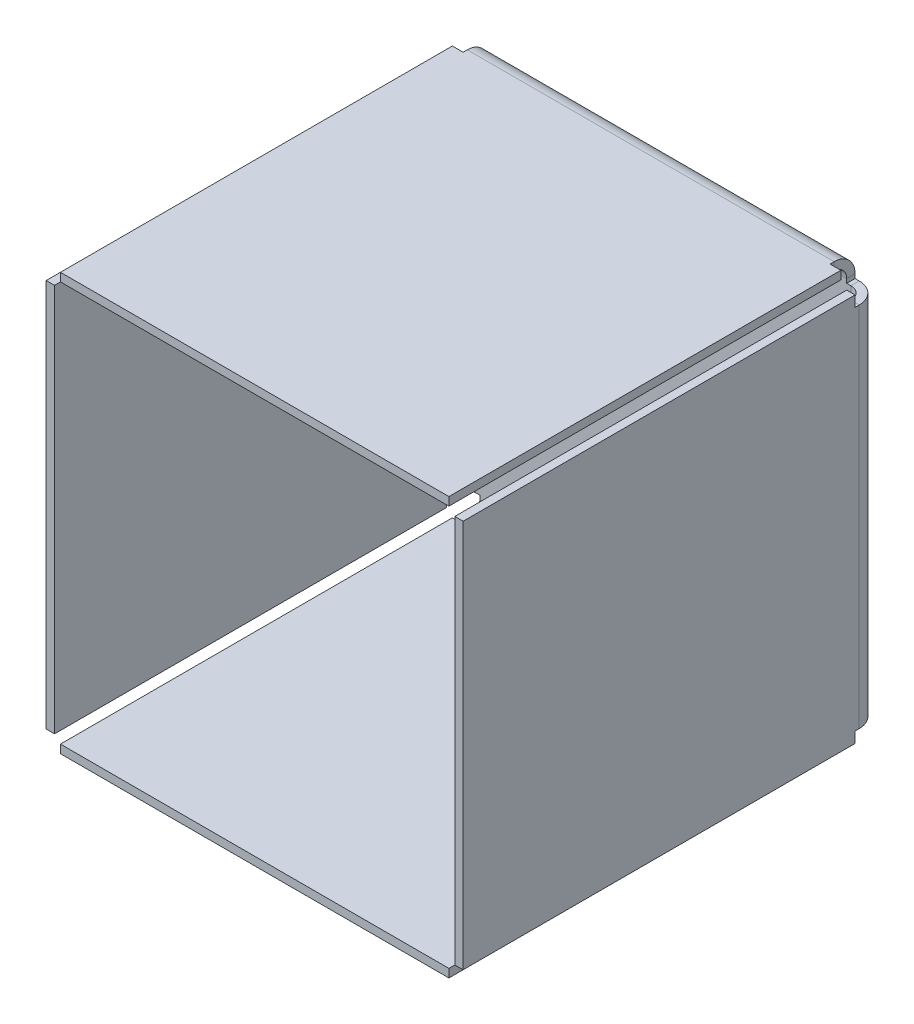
ISO-10303-21;
HEADER;
FILE_DESCRIPTION(('STEP AP214'),'2;1');
FILE_NAME('part.step','',(''),(''),'','','');
FILE_SCHEMA(('AUTOMOTIVE_DESIGN { 1 0 10303 214 1 1 1 1 }'));
ENDSEC;
DATA;
#1=APPLICATION_CONTEXT('core data for automotive mechanical design processes');
#2=APPLICATION_PROTOCOL_DEFINITION('international standard','automotive_design',2000,#1);
#3=PRODUCT_CONTEXT('',#1,'mechanical');
#4=PRODUCT('Part','Part','',(#3));
#5=PRODUCT_RELATED_PRODUCT_CATEGORY('part','',(#4));
#6=PRODUCT_DEFINITION_FORMATION('','',#4);
#7=PRODUCT_DEFINITION_CONTEXT('part definition',#1,'design');
#8=PRODUCT_DEFINITION('design','',#6,#7);
#9=PRODUCT_DEFINITION_SHAPE('','',#8);
#10=(LENGTH_UNIT() NAMED_UNIT(*) SI_UNIT(.MILLI.,.METRE.));
#11=(NAMED_UNIT(*) PLANE_ANGLE_UNIT() SI_UNIT($,.RADIAN.));
#12=(NAMED_UNIT(*) SI_UNIT($,.STERADIAN.) SOLID_ANGLE_UNIT());
#13=UNCERTAINTY_MEASURE_WITH_UNIT(LENGTH_MEASURE(1.E-05),#10,'distance_accuracy_value','');
#14=(GEOMETRIC_REPRESENTATION_CONTEXT(3) GLOBAL_UNCERTAINTY_ASSIGNED_CONTEXT((#13)) GLOBAL_UNIT_ASSIGNED_CONTEXT((#10,
#11,#12)) REPRESENTATION_CONTEXT('',''));
#15=CARTESIAN_POINT('',(0.,0.,0.));
#16=DIRECTION('',(0.,0.,1.));
#17=DIRECTION('',(1.,0.,0.));
#18=AXIS2_PLACEMENT_3D('',#15,#16,#17);
#19=CARTESIAN_POINT('',(-108.063676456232,-23.2928932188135,50.));
#20=DIRECTION('',(0.,1.,0.));
#21=DIRECTION('',(-1.,0.,0.));
#22=AXIS2_PLACEMENT_3D('',#19,#20,#21);
#23=PLANE('',#22);
#24=DIRECTION('',(1.,0.,0.));
#25=VECTOR('',#24,1.);
#26=CARTESIAN_POINT('',(-108.063676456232,-23.2928932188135,2.99999999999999));
#27=LINE('',#26,#25);
#28=CARTESIAN_POINT('',(24.,-23.2928932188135,2.99999999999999));
#29=VERTEX_POINT('',#28);
#30=CARTESIAN_POINT('',(25.,-23.2928932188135,3.));
#31=VERTEX_POINT('',#30);
#32=EDGE_CURVE('E443',#29,#31,#27,.T.);
#33=ORIENTED_EDGE('',*,*,#32,.T.);
#34=DIRECTION('',(0.,0.,-1.));
#35=VECTOR('',#34,1.);
#36=CARTESIAN_POINT('',(25.,-23.2928932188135,76.5));
#37=LINE('',#36,#35);
#38=CARTESIAN_POINT('',(25.,-23.2928932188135,50.));
#39=VERTEX_POINT('',#38);
#40=EDGE_CURVE('E524',#39,#31,#37,.T.);
#41=ORIENTED_EDGE('',*,*,#40,.F.);
#42=DIRECTION('',(1.,0.,0.));
#43=VECTOR('',#42,1.);
#44=CARTESIAN_POINT('',(-108.063676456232,-23.2928932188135,50.));
#45=LINE('',#44,#43);
#46=CARTESIAN_POINT('',(24.,-23.2928932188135,50.));
#47=VERTEX_POINT('',#46);
#48=EDGE_CURVE('E441',#47,#39,#45,.T.);
#49=ORIENTED_EDGE('',*,*,#48,.F.);
#50=DIRECTION('',(0.,0.,1.));
#51=VECTOR('',#50,1.);
#52=CARTESIAN_POINT('',(24.,-23.2928932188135,50.));
#53=LINE('',#52,#51);
#54=EDGE_CURVE('E97',#29,#47,#53,.T.);
#55=ORIENTED_EDGE('',*,*,#54,.F.);
#56=EDGE_LOOP('',(#33,#41,#49,#55));
#57=FACE_BOUND('',#56,.T.);
#58=ADVANCED_FACE('F33',(#57),#23,.F.);
#59=CARTESIAN_POINT('',(-108.063676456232,25.,50.));
#60=DIRECTION('',(0.,0.,-1.));
#61=DIRECTION('',(-1.,0.,0.));
#62=AXIS2_PLACEMENT_3D('',#59,#60,#61);
#63=PLANE('',#62);
#64=ORIENTED_EDGE('',*,*,#48,.T.);
#65=DIRECTION('',(0.,1.,0.));
#66=VECTOR('',#65,1.);
#67=CARTESIAN_POINT('',(25.,-25.,50.));
#68=LINE('',#67,#66);
#69=CARTESIAN_POINT('',(25.,23.2928932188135,50.));
#70=VERTEX_POINT('',#69);
#71=EDGE_CURVE('E438',#39,#70,#68,.T.);
#72=ORIENTED_EDGE('',*,*,#71,.T.);
#73=DIRECTION('',(1.,0.,0.));
#74=VECTOR('',#73,1.);
#75=CARTESIAN_POINT('',(-108.063676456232,23.2928932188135,50.));
#76=LINE('',#75,#74);
#77=CARTESIAN_POINT('',(24.,23.2928932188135,50.));
#78=VERTEX_POINT('',#77);
#79=EDGE_CURVE('E435',#78,#70,#76,.T.);
#80=ORIENTED_EDGE('',*,*,#79,.F.);
#81=DIRECTION('',(0.,1.,0.));
#82=VECTOR('',#81,1.);
#83=CARTESIAN_POINT('',(24.,25.,50.));
#84=LINE('',#83,#82);
#85=EDGE_CURVE('E90',#47,#78,#84,.T.);
#86=ORIENTED_EDGE('',*,*,#85,.F.);
#87=EDGE_LOOP('',(#64,#72,#80,#86));
#88=FACE_BOUND('',#87,.T.);
#89=ADVANCED_FACE('F534',(#88),#63,.F.);
#90=CARTESIAN_POINT('',(-108.063676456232,23.2928932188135,50.));
#91=DIRECTION('',(0.,-1.,0.));
#92=DIRECTION('',(1.,0.,0.));
#93=AXIS2_PLACEMENT_3D('',#90,#91,#92);
#94=PLANE('',#93);
#95=ORIENTED_EDGE('',*,*,#79,.T.);
#96=DIRECTION('',(0.,0.,-1.));
#97=VECTOR('',#96,1.);
#98=CARTESIAN_POINT('',(25.,23.2928932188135,76.5));
#99=LINE('',#98,#97);
#100=CARTESIAN_POINT('',(25.,23.2928932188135,3.));
#101=VERTEX_POINT('',#100);
#102=EDGE_CURVE('E432',#70,#101,#99,.T.);
#103=ORIENTED_EDGE('',*,*,#102,.T.);
#104=DIRECTION('',(1.,0.,0.));
#105=VECTOR('',#104,1.);
#106=CARTESIAN_POINT('',(-108.063676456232,23.2928932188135,2.99999999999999));
#107=LINE('',#106,#105);
#108=CARTESIAN_POINT('',(24.,23.2928932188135,2.99999999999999));
#109=VERTEX_POINT('',#108);
#110=EDGE_CURVE('E427',#109,#101,#107,.T.);
#111=ORIENTED_EDGE('',*,*,#110,.F.);
#112=DIRECTION('',(0.,0.,-1.));
#113=VECTOR('',#112,1.);
#114=CARTESIAN_POINT('',(24.,23.2928932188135,50.));
#115=LINE('',#114,#113);
#116=EDGE_CURVE('E43',#78,#109,#115,.T.);
#117=ORIENTED_EDGE('',*,*,#116,.F.);
#118=EDGE_LOOP('',(#95,#103,#111,#117));
#119=FACE_BOUND('',#118,.T.);
#120=ADVANCED_FACE('F530',(#119),#94,.F.);
#121=CARTESIAN_POINT('',(-108.063676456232,-25.,2.99999999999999));
#122=DIRECTION('',(0.,0.,-1.));
#123=DIRECTION('',(-1.,0.,0.));
#124=AXIS2_PLACEMENT_3D('',#121,#122,#123);
#125=PLANE('',#124);
#126=DIRECTION('',(0.,1.,0.));
#127=VECTOR('',#126,1.);
#128=CARTESIAN_POINT('',(25.,-25.,3.));
#129=LINE('',#128,#127);
#130=CARTESIAN_POINT('',(25.,22.,3.));
#131=VERTEX_POINT('',#130);
#132=EDGE_CURVE('E394',#131,#101,#129,.T.);
#133=ORIENTED_EDGE('',*,*,#132,.F.);
#134=DIRECTION('',(1.,0.,0.));
#135=VECTOR('',#134,1.);
#136=CARTESIAN_POINT('',(-108.063676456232,22.,2.99999999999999));
#137=LINE('',#136,#135);
#138=CARTESIAN_POINT('',(24.,22.,2.99999999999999));
#139=VERTEX_POINT('',#138);
#140=EDGE_CURVE('E521',#139,#131,#137,.T.);
#141=ORIENTED_EDGE('',*,*,#140,.F.);
#142=DIRECTION('',(0.,1.,0.));
#143=VECTOR('',#142,1.);
#144=CARTESIAN_POINT('',(24.,-25.,2.99999999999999));
#145=LINE('',#144,#143);
#146=EDGE_CURVE('E430',#139,#109,#145,.T.);
#147=ORIENTED_EDGE('',*,*,#146,.T.);
#148=ORIENTED_EDGE('',*,*,#110,.T.);
#149=EDGE_LOOP('',(#133,#141,#147,#148));
#150=FACE_BOUND('',#149,.T.);
#151=ADVANCED_FACE('F531',(#150),#125,.T.);
#152=CARTESIAN_POINT('',(-108.063676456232,-25.,2.99999999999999));
#153=DIRECTION('',(0.,0.,-1.));
#154=DIRECTION('',(-1.,0.,0.));
#155=AXIS2_PLACEMENT_3D('',#152,#153,#154);
#156=PLANE('',#155);
#157=DIRECTION('',(0.,1.,0.));
#158=VECTOR('',#157,1.);
#159=CARTESIAN_POINT('',(25.,-25.,3.));
#160=LINE('',#159,#158);
#161=CARTESIAN_POINT('',(25.,-22.,3.));
#162=VERTEX_POINT('',#161);
#163=EDGE_CURVE('E411',#31,#162,#160,.T.);
#164=ORIENTED_EDGE('',*,*,#163,.F.);
#165=ORIENTED_EDGE('',*,*,#32,.F.);
#166=DIRECTION('',(0.,1.,0.));
#167=VECTOR('',#166,1.);
#168=CARTESIAN_POINT('',(24.,-25.,2.99999999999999));
#169=LINE('',#168,#167);
#170=CARTESIAN_POINT('',(24.,-22.,2.99999999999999));
#171=VERTEX_POINT('',#170);
#172=EDGE_CURVE('E423',#29,#171,#169,.T.);
#173=ORIENTED_EDGE('',*,*,#172,.T.);
#174=DIRECTION('',(1.,0.,0.));
#175=VECTOR('',#174,1.);
#176=CARTESIAN_POINT('',(-108.063676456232,-22.,2.99999999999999));
#177=LINE('',#176,#175);
#178=EDGE_CURVE('E421',#171,#162,#177,.T.);
#179=ORIENTED_EDGE('',*,*,#178,.T.);
#180=EDGE_LOOP('',(#164,#165,#173,#179));
#181=FACE_BOUND('',#180,.T.);
#182=ADVANCED_FACE('F538',(#181),#156,.T.);
#183=CARTESIAN_POINT('',(-108.063676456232,-22.,50.));
#184=DIRECTION('',(0.,1.,0.));
#185=DIRECTION('',(-1.,0.,0.));
#186=AXIS2_PLACEMENT_3D('',#183,#184,#185);
#187=PLANE('',#186);
#188=DIRECTION('',(1.,0.,0.));
#189=VECTOR('',#188,1.);
#190=CARTESIAN_POINT('',(-108.063676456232,-22.,2.5));
#191=LINE('',#190,#189);
#192=CARTESIAN_POINT('',(24.,-22.,2.5));
#193=VERTEX_POINT('',#192);
#194=CARTESIAN_POINT('',(25.,-22.,2.5));
#195=VERTEX_POINT('',#194);
#196=EDGE_CURVE('E402',#193,#195,#191,.T.);
#197=ORIENTED_EDGE('',*,*,#196,.T.);
#198=DIRECTION('',(0.,0.,1.));
#199=VECTOR('',#198,1.);
#200=CARTESIAN_POINT('',(25.,-22.,50.));
#201=LINE('',#200,#199);
#202=EDGE_CURVE('E395',#195,#162,#201,.T.);
#203=ORIENTED_EDGE('',*,*,#202,.T.);
#204=ORIENTED_EDGE('',*,*,#178,.F.);
#205=DIRECTION('',(0.,0.,1.));
#206=VECTOR('',#205,1.);
#207=CARTESIAN_POINT('',(24.,-22.,50.));
#208=LINE('',#207,#206);
#209=EDGE_CURVE('E419',#193,#171,#208,.T.);
#210=ORIENTED_EDGE('',*,*,#209,.F.);
#211=EDGE_LOOP('',(#197,#203,#204,#210));
#212=FACE_BOUND('',#211,.T.);
#213=ADVANCED_FACE('F417',(#212),#187,.F.);
#214=CARTESIAN_POINT('',(25.,-25.,50.));
#215=DIRECTION('',(-1.,0.,0.));
#216=DIRECTION('',(0.,0.,1.));
#217=AXIS2_PLACEMENT_3D('',#214,#215,#216);
#218=PLANE('',#217);
#219=ORIENTED_EDGE('',*,*,#202,.F.);
#220=DIRECTION('',(0.,1.,0.));
#221=VECTOR('',#220,1.);
#222=CARTESIAN_POINT('',(25.,-22.,2.5));
#223=LINE('',#222,#221);
#224=CARTESIAN_POINT('',(25.,22.,2.5));
#225=VERTEX_POINT('',#224);
#226=EDGE_CURVE('E384',#195,#225,#223,.T.);
#227=ORIENTED_EDGE('',*,*,#226,.T.);
#228=DIRECTION('',(0.,0.,-1.));
#229=VECTOR('',#228,1.);
#230=CARTESIAN_POINT('',(25.,22.,50.));
#231=LINE('',#230,#229);
#232=EDGE_CURVE('E519',#131,#225,#231,.T.);
#233=ORIENTED_EDGE('',*,*,#232,.F.);
#234=ORIENTED_EDGE('',*,*,#132,.T.);
#235=ORIENTED_EDGE('',*,*,#102,.F.);
#236=ORIENTED_EDGE('',*,*,#71,.F.);
#237=ORIENTED_EDGE('',*,*,#40,.T.);
#238=ORIENTED_EDGE('',*,*,#163,.T.);
#239=EDGE_LOOP('',(#219,#227,#233,#234,#235,#236,#237,#238));
#240=FACE_BOUND('',#239,.T.);
#241=ADVANCED_FACE('F409',(#240),#218,.F.);
#242=CARTESIAN_POINT('',(-108.063676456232,22.,50.));
#243=DIRECTION('',(0.,-1.,0.));
#244=DIRECTION('',(1.,0.,0.));
#245=AXIS2_PLACEMENT_3D('',#242,#243,#244);
#246=PLANE('',#245);
#247=ORIENTED_EDGE('',*,*,#140,.T.);
#248=ORIENTED_EDGE('',*,*,#232,.T.);
#249=DIRECTION('',(1.,0.,0.));
#250=VECTOR('',#249,1.);
#251=CARTESIAN_POINT('',(-108.063676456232,22.,2.5));
#252=LINE('',#251,#250);
#253=CARTESIAN_POINT('',(24.,22.,2.5));
#254=VERTEX_POINT('',#253);
#255=EDGE_CURVE('E444',#254,#225,#252,.T.);
#256=ORIENTED_EDGE('',*,*,#255,.F.);
#257=DIRECTION('',(0.,0.,-1.));
#258=VECTOR('',#257,1.);
#259=CARTESIAN_POINT('',(24.,22.,50.));
#260=LINE('',#259,#258);
#261=EDGE_CURVE('E11',#139,#254,#260,.T.);
#262=ORIENTED_EDGE('',*,*,#261,.F.);
#263=EDGE_LOOP('',(#247,#248,#256,#262));
#264=FACE_BOUND('',#263,.T.);
#265=ADVANCED_FACE('F585',(#264),#246,.F.);
#266=CARTESIAN_POINT('',(24.,-25.,50.));
#267=DIRECTION('',(-1.,0.,0.));
#268=DIRECTION('',(0.,0.,1.));
#269=AXIS2_PLACEMENT_3D('',#266,#267,#268);
#270=PLANE('',#269);
#271=DIRECTION('',(0.,1.,0.));
#272=VECTOR('',#271,1.);
#273=CARTESIAN_POINT('',(24.,-22.,2.5));
#274=LINE('',#273,#272);
#275=EDGE_CURVE('E37',#193,#254,#274,.T.);
#276=ORIENTED_EDGE('',*,*,#275,.F.);
#277=ORIENTED_EDGE('',*,*,#209,.T.);
#278=ORIENTED_EDGE('',*,*,#172,.F.);
#279=ORIENTED_EDGE('',*,*,#54,.T.);
#280=ORIENTED_EDGE('',*,*,#85,.T.);
#281=ORIENTED_EDGE('',*,*,#116,.T.);
#282=ORIENTED_EDGE('',*,*,#146,.F.);
#283=ORIENTED_EDGE('',*,*,#261,.T.);
#284=EDGE_LOOP('',(#276,#277,#278,#279,#280,#281,#282,#283));
#285=FACE_BOUND('',#284,.T.);
#286=ADVANCED_FACE('F35',(#285),#270,.T.);
#287=CARTESIAN_POINT('',(23.2928932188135,-108.063676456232,50.));
#288=DIRECTION('',(-1.,0.,0.));
#289=DIRECTION('',(0.,-1.,0.));
#290=AXIS2_PLACEMENT_3D('',#287,#288,#289);
#291=PLANE('',#290);
#292=DIRECTION('',(0.,1.,0.));
#293=VECTOR('',#292,1.);
#294=CARTESIAN_POINT('',(23.2928932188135,-108.063676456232,2.99999999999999));
#295=LINE('',#294,#293);
#296=CARTESIAN_POINT('',(23.2928932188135,24.,2.99999999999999));
#297=VERTEX_POINT('',#296);
#298=CARTESIAN_POINT('',(23.2928932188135,25.,3.));
#299=VERTEX_POINT('',#298);
#300=EDGE_CURVE('E507',#297,#299,#295,.T.);
#301=ORIENTED_EDGE('',*,*,#300,.T.);
#302=DIRECTION('',(0.,0.,-1.));
#303=VECTOR('',#302,1.);
#304=CARTESIAN_POINT('',(23.2928932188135,25.,76.5));
#305=LINE('',#304,#303);
#306=CARTESIAN_POINT('',(23.2928932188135,25.,50.));
#307=VERTEX_POINT('',#306);
#308=EDGE_CURVE('E473',#307,#299,#305,.T.);
#309=ORIENTED_EDGE('',*,*,#308,.F.);
#310=DIRECTION('',(0.,1.,0.));
#311=VECTOR('',#310,1.);
#312=CARTESIAN_POINT('',(23.2928932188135,-108.063676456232,50.));
#313=LINE('',#312,#311);
#314=CARTESIAN_POINT('',(23.2928932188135,24.,50.));
#315=VERTEX_POINT('',#314);
#316=EDGE_CURVE('E505',#315,#307,#313,.T.);
#317=ORIENTED_EDGE('',*,*,#316,.F.);
#318=DIRECTION('',(0.,0.,1.));
#319=VECTOR('',#318,1.);
#320=CARTESIAN_POINT('',(23.2928932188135,24.,50.));
#321=LINE('',#320,#319);
#322=EDGE_CURVE('E153',#297,#315,#321,.T.);
#323=ORIENTED_EDGE('',*,*,#322,.F.);
#324=EDGE_LOOP('',(#301,#309,#317,#323));
#325=FACE_BOUND('',#324,.T.);
#326=ADVANCED_FACE('F601',(#325),#291,.F.);
#327=CARTESIAN_POINT('',(25.,-108.063676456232,50.));
#328=DIRECTION('',(0.,0.,-1.));
#329=DIRECTION('',(0.,1.,0.));
#330=AXIS2_PLACEMENT_3D('',#327,#328,#329);
#331=PLANE('',#330);
#332=ORIENTED_EDGE('',*,*,#316,.T.);
#333=DIRECTION('',(-1.,0.,0.));
#334=VECTOR('',#333,1.);
#335=CARTESIAN_POINT('',(-25.,25.,50.));
#336=LINE('',#335,#334);
#337=CARTESIAN_POINT('',(-23.2928932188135,25.,50.));
#338=VERTEX_POINT('',#337);
#339=EDGE_CURVE('E502',#307,#338,#336,.T.);
#340=ORIENTED_EDGE('',*,*,#339,.T.);
#341=DIRECTION('',(0.,1.,0.));
#342=VECTOR('',#341,1.);
#343=CARTESIAN_POINT('',(-23.2928932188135,-108.063676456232,50.));
#344=LINE('',#343,#342);
#345=CARTESIAN_POINT('',(-23.2928932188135,24.,50.));
#346=VERTEX_POINT('',#345);
#347=EDGE_CURVE('E499',#346,#338,#344,.T.);
#348=ORIENTED_EDGE('',*,*,#347,.F.);
#349=DIRECTION('',(-1.,0.,0.));
#350=VECTOR('',#349,1.);
#351=CARTESIAN_POINT('',(25.,24.,50.));
#352=LINE('',#351,#350);
#353=EDGE_CURVE('E146',#315,#346,#352,.T.);
#354=ORIENTED_EDGE('',*,*,#353,.F.);
#355=EDGE_LOOP('',(#332,#340,#348,#354));
#356=FACE_BOUND('',#355,.T.);
#357=ADVANCED_FACE('F609',(#356),#331,.F.);
#358=CARTESIAN_POINT('',(-23.2928932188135,-108.063676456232,50.));
#359=DIRECTION('',(1.,0.,0.));
#360=DIRECTION('',(0.,1.,0.));
#361=AXIS2_PLACEMENT_3D('',#358,#359,#360);
#362=PLANE('',#361);
#363=ORIENTED_EDGE('',*,*,#347,.T.);
#364=DIRECTION('',(0.,0.,-1.));
#365=VECTOR('',#364,1.);
#366=CARTESIAN_POINT('',(-23.2928932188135,25.,76.5));
#367=LINE('',#366,#365);
#368=CARTESIAN_POINT('',(-23.2928932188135,25.,3.));
#369=VERTEX_POINT('',#368);
#370=EDGE_CURVE('E496',#338,#369,#367,.T.);
#371=ORIENTED_EDGE('',*,*,#370,.T.);
#372=DIRECTION('',(0.,1.,0.));
#373=VECTOR('',#372,1.);
#374=CARTESIAN_POINT('',(-23.2928932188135,-108.063676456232,2.99999999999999));
#375=LINE('',#374,#373);
#376=CARTESIAN_POINT('',(-23.2928932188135,24.,2.99999999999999));
#377=VERTEX_POINT('',#376);
#378=EDGE_CURVE('E491',#377,#369,#375,.T.);
#379=ORIENTED_EDGE('',*,*,#378,.F.);
#380=DIRECTION('',(0.,0.,-1.));
#381=VECTOR('',#380,1.);
#382=CARTESIAN_POINT('',(-23.2928932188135,24.,50.));
#383=LINE('',#382,#381);
#384=EDGE_CURVE('E450',#346,#377,#383,.T.);
#385=ORIENTED_EDGE('',*,*,#384,.F.);
#386=EDGE_LOOP('',(#363,#371,#379,#385));
#387=FACE_BOUND('',#386,.T.);
#388=ADVANCED_FACE('F618',(#387),#362,.F.);
#389=CARTESIAN_POINT('',(-25.,-108.063676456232,2.99999999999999));
#390=DIRECTION('',(0.,0.,-1.));
#391=DIRECTION('',(0.,1.,0.));
#392=AXIS2_PLACEMENT_3D('',#389,#390,#391);
#393=PLANE('',#392);
#394=DIRECTION('',(-1.,0.,0.));
#395=VECTOR('',#394,1.);
#396=CARTESIAN_POINT('',(-25.,25.,3.));
#397=LINE('',#396,#395);
#398=CARTESIAN_POINT('',(-22.,25.,3.));
#399=VERTEX_POINT('',#398);
#400=EDGE_CURVE('E475',#399,#369,#397,.T.);
#401=ORIENTED_EDGE('',*,*,#400,.F.);
#402=DIRECTION('',(0.,1.,0.));
#403=VECTOR('',#402,1.);
#404=CARTESIAN_POINT('',(-22.,-108.063676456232,2.99999999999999));
#405=LINE('',#404,#403);
#406=CARTESIAN_POINT('',(-22.,24.,2.99999999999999));
#407=VERTEX_POINT('',#406);
#408=EDGE_CURVE('E469',#407,#399,#405,.T.);
#409=ORIENTED_EDGE('',*,*,#408,.F.);
#410=DIRECTION('',(-1.,0.,0.));
#411=VECTOR('',#410,1.);
#412=CARTESIAN_POINT('',(-25.,24.,2.99999999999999));
#413=LINE('',#412,#411);
#414=EDGE_CURVE('E494',#407,#377,#413,.T.);
#415=ORIENTED_EDGE('',*,*,#414,.T.);
#416=ORIENTED_EDGE('',*,*,#378,.T.);
#417=EDGE_LOOP('',(#401,#409,#415,#416));
#418=FACE_BOUND('',#417,.T.);
#419=ADVANCED_FACE('F627',(#418),#393,.T.);
#420=CARTESIAN_POINT('',(-25.,-108.063676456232,2.99999999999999));
#421=DIRECTION('',(0.,0.,-1.));
#422=DIRECTION('',(0.,1.,0.));
#423=AXIS2_PLACEMENT_3D('',#420,#421,#422);
#424=PLANE('',#423);
#425=DIRECTION('',(-1.,0.,0.));
#426=VECTOR('',#425,1.);
#427=CARTESIAN_POINT('',(-25.,25.,3.));
#428=LINE('',#427,#426);
#429=CARTESIAN_POINT('',(22.,25.,3.));
#430=VERTEX_POINT('',#429);
#431=EDGE_CURVE('E471',#299,#430,#428,.T.);
#432=ORIENTED_EDGE('',*,*,#431,.F.);
#433=ORIENTED_EDGE('',*,*,#300,.F.);
#434=DIRECTION('',(-1.,0.,0.));
#435=VECTOR('',#434,1.);
#436=CARTESIAN_POINT('',(-25.,24.,2.99999999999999));
#437=LINE('',#436,#435);
#438=CARTESIAN_POINT('',(22.,24.,2.99999999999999));
#439=VERTEX_POINT('',#438);
#440=EDGE_CURVE('E489',#297,#439,#437,.T.);
#441=ORIENTED_EDGE('',*,*,#440,.T.);
#442=DIRECTION('',(0.,1.,0.));
#443=VECTOR('',#442,1.);
#444=CARTESIAN_POINT('',(22.,-108.063676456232,2.99999999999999));
#445=LINE('',#444,#443);
#446=EDGE_CURVE('E486',#439,#430,#445,.T.);
#447=ORIENTED_EDGE('',*,*,#446,.T.);
#448=EDGE_LOOP('',(#432,#433,#441,#447));
#449=FACE_BOUND('',#448,.T.);
#450=ADVANCED_FACE('F637',(#449),#424,.T.);
#451=CARTESIAN_POINT('',(22.,-108.063676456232,50.));
#452=DIRECTION('',(-1.,0.,0.));
#453=DIRECTION('',(0.,-1.,0.));
#454=AXIS2_PLACEMENT_3D('',#451,#452,#453);
#455=PLANE('',#454);
#456=DIRECTION('',(0.,1.,0.));
#457=VECTOR('',#456,1.);
#458=CARTESIAN_POINT('',(22.,-108.063676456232,2.5));
#459=LINE('',#458,#457);
#460=CARTESIAN_POINT('',(22.,24.,2.5));
#461=VERTEX_POINT('',#460);
#462=CARTESIAN_POINT('',(22.,25.,2.5));
#463=VERTEX_POINT('',#462);
#464=EDGE_CURVE('E483',#461,#463,#459,.T.);
#465=ORIENTED_EDGE('',*,*,#464,.T.);
#466=DIRECTION('',(0.,0.,1.));
#467=VECTOR('',#466,1.);
#468=CARTESIAN_POINT('',(22.,25.,50.));
#469=LINE('',#468,#467);
#470=EDGE_CURVE('E480',#463,#430,#469,.T.);
#471=ORIENTED_EDGE('',*,*,#470,.T.);
#472=ORIENTED_EDGE('',*,*,#446,.F.);
#473=DIRECTION('',(0.,0.,1.));
#474=VECTOR('',#473,1.);
#475=CARTESIAN_POINT('',(22.,24.,50.));
#476=LINE('',#475,#474);
#477=EDGE_CURVE('E463',#461,#439,#476,.T.);
#478=ORIENTED_EDGE('',*,*,#477,.F.);
#479=EDGE_LOOP('',(#465,#471,#472,#478));
#480=FACE_BOUND('',#479,.T.);
#481=ADVANCED_FACE('F647',(#480),#455,.F.);
#482=CARTESIAN_POINT('',(-25.,25.,50.));
#483=DIRECTION('',(0.,-1.,0.));
#484=DIRECTION('',(0.,0.,-1.));
#485=AXIS2_PLACEMENT_3D('',#482,#483,#484);
#486=PLANE('',#485);
#487=ORIENTED_EDGE('',*,*,#470,.F.);
#488=DIRECTION('',(-1.,0.,0.));
#489=VECTOR('',#488,1.);
#490=CARTESIAN_POINT('',(22.,25.,2.5));
#491=LINE('',#490,#489);
#492=CARTESIAN_POINT('',(-22.,25.,2.5));
#493=VERTEX_POINT('',#492);
#494=EDGE_CURVE('E477',#463,#493,#491,.T.);
#495=ORIENTED_EDGE('',*,*,#494,.T.);
#496=DIRECTION('',(0.,0.,-1.));
#497=VECTOR('',#496,1.);
#498=CARTESIAN_POINT('',(-22.,25.,50.));
#499=LINE('',#498,#497);
#500=EDGE_CURVE('E466',#399,#493,#499,.T.);
#501=ORIENTED_EDGE('',*,*,#500,.F.);
#502=ORIENTED_EDGE('',*,*,#400,.T.);
#503=ORIENTED_EDGE('',*,*,#370,.F.);
#504=ORIENTED_EDGE('',*,*,#339,.F.);
#505=ORIENTED_EDGE('',*,*,#308,.T.);
#506=ORIENTED_EDGE('',*,*,#431,.T.);
#507=EDGE_LOOP('',(#487,#495,#501,#502,#503,#504,#505,#506));
#508=FACE_BOUND('',#507,.T.);
#509=ADVANCED_FACE('F657',(#508),#486,.F.);
#510=CARTESIAN_POINT('',(-22.,-108.063676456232,50.));
#511=DIRECTION('',(1.,0.,0.));
#512=DIRECTION('',(0.,1.,0.));
#513=AXIS2_PLACEMENT_3D('',#510,#511,#512);
#514=PLANE('',#513);
#515=ORIENTED_EDGE('',*,*,#408,.T.);
#516=ORIENTED_EDGE('',*,*,#500,.T.);
#517=DIRECTION('',(0.,1.,0.));
#518=VECTOR('',#517,1.);
#519=CARTESIAN_POINT('',(-22.,-108.063676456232,2.5));
#520=LINE('',#519,#518);
#521=CARTESIAN_POINT('',(-22.,24.,2.5));
#522=VERTEX_POINT('',#521);
#523=EDGE_CURVE('E509',#522,#493,#520,.T.);
#524=ORIENTED_EDGE('',*,*,#523,.F.);
#525=DIRECTION('',(0.,0.,-1.));
#526=VECTOR('',#525,1.);
#527=CARTESIAN_POINT('',(-22.,24.,50.));
#528=LINE('',#527,#526);
#529=EDGE_CURVE('E106',#407,#522,#528,.T.);
#530=ORIENTED_EDGE('',*,*,#529,.F.);
#531=EDGE_LOOP('',(#515,#516,#524,#530));
#532=FACE_BOUND('',#531,.T.);
#533=ADVANCED_FACE('F667',(#532),#514,.F.);
#534=CARTESIAN_POINT('',(-25.,24.,50.));
#535=DIRECTION('',(0.,-1.,0.));
#536=DIRECTION('',(0.,0.,-1.));
#537=AXIS2_PLACEMENT_3D('',#534,#535,#536);
#538=PLANE('',#537);
#539=DIRECTION('',(-1.,0.,0.));
#540=VECTOR('',#539,1.);
#541=CARTESIAN_POINT('',(22.,24.,2.5));
#542=LINE('',#541,#540);
#543=EDGE_CURVE('E512',#461,#522,#542,.T.);
#544=ORIENTED_EDGE('',*,*,#543,.F.);
#545=ORIENTED_EDGE('',*,*,#477,.T.);
#546=ORIENTED_EDGE('',*,*,#440,.F.);
#547=ORIENTED_EDGE('',*,*,#322,.T.);
#548=ORIENTED_EDGE('',*,*,#353,.T.);
#549=ORIENTED_EDGE('',*,*,#384,.T.);
#550=ORIENTED_EDGE('',*,*,#414,.F.);
#551=ORIENTED_EDGE('',*,*,#529,.T.);
#552=EDGE_LOOP('',(#544,#545,#546,#547,#548,#549,#550,#551));
#553=FACE_BOUND('',#552,.T.);
#554=ADVANCED_FACE('F554',(#553),#538,.T.);
#555=CARTESIAN_POINT('',(108.063676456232,23.2928932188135,50.));
#556=DIRECTION('',(0.,-1.,0.));
#557=DIRECTION('',(-1.,0.,0.));
#558=AXIS2_PLACEMENT_3D('',#555,#556,#557);
#559=PLANE('',#558);
#560=DIRECTION('',(-1.,0.,0.));
#561=VECTOR('',#560,1.);
#562=CARTESIAN_POINT('',(108.063676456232,23.2928932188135,2.99999999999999));
#563=LINE('',#562,#561);
#564=CARTESIAN_POINT('',(-24.,23.2928932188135,2.99999999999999));
#565=VERTEX_POINT('',#564);
#566=CARTESIAN_POINT('',(-25.,23.2928932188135,3.));
#567=VERTEX_POINT('',#566);
#568=EDGE_CURVE('E1263',#565,#567,#563,.T.);
#569=ORIENTED_EDGE('',*,*,#568,.T.);
#570=DIRECTION('',(0.,0.,-1.));
#571=VECTOR('',#570,1.);
#572=CARTESIAN_POINT('',(-25.,23.2928932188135,76.5));
#573=LINE('',#572,#571);
#574=CARTESIAN_POINT('',(-25.,23.2928932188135,50.));
#575=VERTEX_POINT('',#574);
#576=EDGE_CURVE('E1229',#575,#567,#573,.T.);
#577=ORIENTED_EDGE('',*,*,#576,.F.);
#578=DIRECTION('',(-1.,0.,0.));
#579=VECTOR('',#578,1.);
#580=CARTESIAN_POINT('',(108.063676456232,23.2928932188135,50.));
#581=LINE('',#580,#579);
#582=CARTESIAN_POINT('',(-24.,23.2928932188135,50.));
#583=VERTEX_POINT('',#582);
#584=EDGE_CURVE('E1261',#583,#575,#581,.T.);
#585=ORIENTED_EDGE('',*,*,#584,.F.);
#586=DIRECTION('',(0.,0.,1.));
#587=VECTOR('',#586,1.);
#588=CARTESIAN_POINT('',(-24.,23.2928932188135,50.));
#589=LINE('',#588,#587);
#590=EDGE_CURVE('E209',#565,#583,#589,.T.);
#591=ORIENTED_EDGE('',*,*,#590,.F.);
#592=EDGE_LOOP('',(#569,#577,#585,#591));
#593=FACE_BOUND('',#592,.T.);
#594=ADVANCED_FACE('F684',(#593),#559,.F.);
#595=CARTESIAN_POINT('',(108.063676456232,25.,50.));
#596=DIRECTION('',(0.,0.,-1.));
#597=DIRECTION('',(-1.,0.,0.));
#598=AXIS2_PLACEMENT_3D('',#595,#596,#597);
#599=PLANE('',#598);
#600=ORIENTED_EDGE('',*,*,#584,.T.);
#601=DIRECTION('',(0.,-1.,0.));
#602=VECTOR('',#601,1.);
#603=CARTESIAN_POINT('',(-25.,-25.,50.));
#604=LINE('',#603,#602);
#605=CARTESIAN_POINT('',(-25.,-23.2928932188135,50.));
#606=VERTEX_POINT('',#605);
#607=EDGE_CURVE('E1258',#575,#606,#604,.T.);
#608=ORIENTED_EDGE('',*,*,#607,.T.);
#609=DIRECTION('',(-1.,0.,0.));
#610=VECTOR('',#609,1.);
#611=CARTESIAN_POINT('',(108.063676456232,-23.2928932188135,50.));
#612=LINE('',#611,#610);
#613=CARTESIAN_POINT('',(-24.,-23.2928932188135,50.));
#614=VERTEX_POINT('',#613);
#615=EDGE_CURVE('E1255',#614,#606,#612,.T.);
#616=ORIENTED_EDGE('',*,*,#615,.F.);
#617=DIRECTION('',(0.,-1.,0.));
#618=VECTOR('',#617,1.);
#619=CARTESIAN_POINT('',(-24.,25.,50.));
#620=LINE('',#619,#618);
#621=EDGE_CURVE('E202',#583,#614,#620,.T.);
#622=ORIENTED_EDGE('',*,*,#621,.F.);
#623=EDGE_LOOP('',(#600,#608,#616,#622));
#624=FACE_BOUND('',#623,.T.);
#625=ADVANCED_FACE('F692',(#624),#599,.F.);
#626=CARTESIAN_POINT('',(108.063676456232,-23.2928932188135,50.));
#627=DIRECTION('',(0.,1.,0.));
#628=DIRECTION('',(1.,0.,0.));
#629=AXIS2_PLACEMENT_3D('',#626,#627,#628);
#630=PLANE('',#629);
#631=ORIENTED_EDGE('',*,*,#615,.T.);
#632=DIRECTION('',(0.,0.,-1.));
#633=VECTOR('',#632,1.);
#634=CARTESIAN_POINT('',(-25.,-23.2928932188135,76.5));
#635=LINE('',#634,#633);
#636=CARTESIAN_POINT('',(-25.,-23.2928932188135,3.));
#637=VERTEX_POINT('',#636);
#638=EDGE_CURVE('E1252',#606,#637,#635,.T.);
#639=ORIENTED_EDGE('',*,*,#638,.T.);
#640=DIRECTION('',(-1.,0.,0.));
#641=VECTOR('',#640,1.);
#642=CARTESIAN_POINT('',(108.063676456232,-23.2928932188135,2.99999999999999));
#643=LINE('',#642,#641);
#644=CARTESIAN_POINT('',(-24.,-23.2928932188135,2.99999999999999));
#645=VERTEX_POINT('',#644);
#646=EDGE_CURVE('E1247',#645,#637,#643,.T.);
#647=ORIENTED_EDGE('',*,*,#646,.F.);
#648=DIRECTION('',(0.,0.,-1.));
#649=VECTOR('',#648,1.);
#650=CARTESIAN_POINT('',(-24.,-23.2928932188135,50.));
#651=LINE('',#650,#649);
#652=EDGE_CURVE('E1214',#614,#645,#651,.T.);
#653=ORIENTED_EDGE('',*,*,#652,.F.);
#654=EDGE_LOOP('',(#631,#639,#647,#653));
#655=FACE_BOUND('',#654,.T.);
#656=ADVANCED_FACE('F701',(#655),#630,.F.);
#657=CARTESIAN_POINT('',(108.063676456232,-25.,2.99999999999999));
#658=DIRECTION('',(0.,0.,-1.));
#659=DIRECTION('',(-1.,0.,0.));
#660=AXIS2_PLACEMENT_3D('',#657,#658,#659);
#661=PLANE('',#660);
#662=DIRECTION('',(0.,-1.,0.));
#663=VECTOR('',#662,1.);
#664=CARTESIAN_POINT('',(-25.,-25.,3.));
#665=LINE('',#664,#663);
#666=CARTESIAN_POINT('',(-25.,-22.,3.));
#667=VERTEX_POINT('',#666);
#668=EDGE_CURVE('E1231',#667,#637,#665,.T.);
#669=ORIENTED_EDGE('',*,*,#668,.F.);
#670=DIRECTION('',(-1.,0.,0.));
#671=VECTOR('',#670,1.);
#672=CARTESIAN_POINT('',(108.063676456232,-22.,2.99999999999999));
#673=LINE('',#672,#671);
#674=CARTESIAN_POINT('',(-24.,-22.,2.99999999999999));
#675=VERTEX_POINT('',#674);
#676=EDGE_CURVE('E1225',#675,#667,#673,.T.);
#677=ORIENTED_EDGE('',*,*,#676,.F.);
#678=DIRECTION('',(0.,-1.,0.));
#679=VECTOR('',#678,1.);
#680=CARTESIAN_POINT('',(-24.,-25.,2.99999999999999));
#681=LINE('',#680,#679);
#682=EDGE_CURVE('E1250',#675,#645,#681,.T.);
#683=ORIENTED_EDGE('',*,*,#682,.T.);
#684=ORIENTED_EDGE('',*,*,#646,.T.);
#685=EDGE_LOOP('',(#669,#677,#683,#684));
#686=FACE_BOUND('',#685,.T.);
#687=ADVANCED_FACE('F710',(#686),#661,.T.);
#688=CARTESIAN_POINT('',(108.063676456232,-25.,2.99999999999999));
#689=DIRECTION('',(0.,0.,-1.));
#690=DIRECTION('',(-1.,0.,0.));
#691=AXIS2_PLACEMENT_3D('',#688,#689,#690);
#692=PLANE('',#691);
#693=DIRECTION('',(0.,-1.,0.));
#694=VECTOR('',#693,1.);
#695=CARTESIAN_POINT('',(-25.,-25.,3.));
#696=LINE('',#695,#694);
#697=CARTESIAN_POINT('',(-25.,22.,3.));
#698=VERTEX_POINT('',#697);
#699=EDGE_CURVE('E1227',#567,#698,#696,.T.);
#700=ORIENTED_EDGE('',*,*,#699,.F.);
#701=ORIENTED_EDGE('',*,*,#568,.F.);
#702=DIRECTION('',(0.,-1.,0.));
#703=VECTOR('',#702,1.);
#704=CARTESIAN_POINT('',(-24.,-25.,2.99999999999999));
#705=LINE('',#704,#703);
#706=CARTESIAN_POINT('',(-24.,22.,2.99999999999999));
#707=VERTEX_POINT('',#706);
#708=EDGE_CURVE('E1245',#565,#707,#705,.T.);
#709=ORIENTED_EDGE('',*,*,#708,.T.);
#710=DIRECTION('',(-1.,0.,0.));
#711=VECTOR('',#710,1.);
#712=CARTESIAN_POINT('',(108.063676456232,22.,2.99999999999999));
#713=LINE('',#712,#711);
#714=EDGE_CURVE('E1242',#707,#698,#713,.T.);
#715=ORIENTED_EDGE('',*,*,#714,.T.);
#716=EDGE_LOOP('',(#700,#701,#709,#715));
#717=FACE_BOUND('',#716,.T.);
#718=ADVANCED_FACE('F720',(#717),#692,.T.);
#719=CARTESIAN_POINT('',(108.063676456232,22.,50.));
#720=DIRECTION('',(0.,-1.,0.));
#721=DIRECTION('',(-1.,0.,0.));
#722=AXIS2_PLACEMENT_3D('',#719,#720,#721);
#723=PLANE('',#722);
#724=DIRECTION('',(-1.,0.,0.));
#725=VECTOR('',#724,1.);
#726=CARTESIAN_POINT('',(108.063676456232,22.,2.5));
#727=LINE('',#726,#725);
#728=CARTESIAN_POINT('',(-24.,22.,2.5));
#729=VERTEX_POINT('',#728);
#730=CARTESIAN_POINT('',(-25.,22.,2.5));
#731=VERTEX_POINT('',#730);
#732=EDGE_CURVE('E1239',#729,#731,#727,.T.);
#733=ORIENTED_EDGE('',*,*,#732,.T.);
#734=DIRECTION('',(0.,0.,1.));
#735=VECTOR('',#734,1.);
#736=CARTESIAN_POINT('',(-25.,22.,50.));
#737=LINE('',#736,#735);
#738=EDGE_CURVE('E1236',#731,#698,#737,.T.);
#739=ORIENTED_EDGE('',*,*,#738,.T.);
#740=ORIENTED_EDGE('',*,*,#714,.F.);
#741=DIRECTION('',(0.,0.,1.));
#742=VECTOR('',#741,1.);
#743=CARTESIAN_POINT('',(-24.,22.,50.));
#744=LINE('',#743,#742);
#745=EDGE_CURVE('E1219',#729,#707,#744,.T.);
#746=ORIENTED_EDGE('',*,*,#745,.F.);
#747=EDGE_LOOP('',(#733,#739,#740,#746));
#748=FACE_BOUND('',#747,.T.);
#749=ADVANCED_FACE('F730',(#748),#723,.F.);
#750=CARTESIAN_POINT('',(-25.,-25.,50.));
#751=DIRECTION('',(1.,0.,0.));
#752=DIRECTION('',(0.,0.,-1.));
#753=AXIS2_PLACEMENT_3D('',#750,#751,#752);
#754=PLANE('',#753);
#755=ORIENTED_EDGE('',*,*,#738,.F.);
#756=DIRECTION('',(0.,-1.,0.));
#757=VECTOR('',#756,1.);
#758=CARTESIAN_POINT('',(-25.,22.,2.5));
#759=LINE('',#758,#757);
#760=CARTESIAN_POINT('',(-25.,-22.,2.5));
#761=VERTEX_POINT('',#760);
#762=EDGE_CURVE('E1233',#731,#761,#759,.T.);
#763=ORIENTED_EDGE('',*,*,#762,.T.);
#764=DIRECTION('',(0.,0.,-1.));
#765=VECTOR('',#764,1.);
#766=CARTESIAN_POINT('',(-25.,-22.,50.));
#767=LINE('',#766,#765);
#768=EDGE_CURVE('E1222',#667,#761,#767,.T.);
#769=ORIENTED_EDGE('',*,*,#768,.F.);
#770=ORIENTED_EDGE('',*,*,#668,.T.);
#771=ORIENTED_EDGE('',*,*,#638,.F.);
#772=ORIENTED_EDGE('',*,*,#607,.F.);
#773=ORIENTED_EDGE('',*,*,#576,.T.);
#774=ORIENTED_EDGE('',*,*,#699,.T.);
#775=EDGE_LOOP('',(#755,#763,#769,#770,#771,#772,#773,#774));
#776=FACE_BOUND('',#775,.T.);
#777=ADVANCED_FACE('F740',(#776),#754,.F.);
#778=CARTESIAN_POINT('',(108.063676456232,-22.,50.));
#779=DIRECTION('',(0.,1.,0.));
#780=DIRECTION('',(1.,0.,0.));
#781=AXIS2_PLACEMENT_3D('',#778,#779,#780);
#782=PLANE('',#781);
#783=ORIENTED_EDGE('',*,*,#676,.T.);
#784=ORIENTED_EDGE('',*,*,#768,.T.);
#785=DIRECTION('',(-1.,0.,0.));
#786=VECTOR('',#785,1.);
#787=CARTESIAN_POINT('',(108.063676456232,-22.,2.5));
#788=LINE('',#787,#786);
#789=CARTESIAN_POINT('',(-24.,-22.,2.5));
#790=VERTEX_POINT('',#789);
#791=EDGE_CURVE('E1264',#790,#761,#788,.T.);
#792=ORIENTED_EDGE('',*,*,#791,.F.);
#793=DIRECTION('',(0.,0.,-1.));
#794=VECTOR('',#793,1.);
#795=CARTESIAN_POINT('',(-24.,-22.,50.));
#796=LINE('',#795,#794);
#797=EDGE_CURVE('E162',#675,#790,#796,.T.);
#798=ORIENTED_EDGE('',*,*,#797,.F.);
#799=EDGE_LOOP('',(#783,#784,#792,#798));
#800=FACE_BOUND('',#799,.T.);
#801=ADVANCED_FACE('F750',(#800),#782,.F.);
#802=CARTESIAN_POINT('',(-24.,-25.,50.));
#803=DIRECTION('',(1.,0.,0.));
#804=DIRECTION('',(0.,0.,-1.));
#805=AXIS2_PLACEMENT_3D('',#802,#803,#804);
#806=PLANE('',#805);
#807=DIRECTION('',(0.,-1.,0.));
#808=VECTOR('',#807,1.);
#809=CARTESIAN_POINT('',(-24.,22.,2.5));
#810=LINE('',#809,#808);
#811=EDGE_CURVE('E458',#729,#790,#810,.T.);
#812=ORIENTED_EDGE('',*,*,#811,.F.);
#813=ORIENTED_EDGE('',*,*,#745,.T.);
#814=ORIENTED_EDGE('',*,*,#708,.F.);
#815=ORIENTED_EDGE('',*,*,#590,.T.);
#816=ORIENTED_EDGE('',*,*,#621,.T.);
#817=ORIENTED_EDGE('',*,*,#652,.T.);
#818=ORIENTED_EDGE('',*,*,#682,.F.);
#819=ORIENTED_EDGE('',*,*,#797,.T.);
#820=EDGE_LOOP('',(#812,#813,#814,#815,#816,#817,#818,#819));
#821=FACE_BOUND('',#820,.T.);
#822=ADVANCED_FACE('F760',(#821),#806,.T.);
#823=CARTESIAN_POINT('',(-23.2928932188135,108.063676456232,50.));
#824=DIRECTION('',(1.,0.,0.));
#825=DIRECTION('',(0.,-1.,0.));
#826=AXIS2_PLACEMENT_3D('',#823,#824,#825);
#827=PLANE('',#826);
#828=DIRECTION('',(0.,-1.,0.));
#829=VECTOR('',#828,1.);
#830=CARTESIAN_POINT('',(-23.2928932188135,108.063676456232,2.99999999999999));
#831=LINE('',#830,#829);
#832=CARTESIAN_POINT('',(-23.2928932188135,-24.,2.99999999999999));
#833=VERTEX_POINT('',#832);
#834=CARTESIAN_POINT('',(-23.2928932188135,-25.,3.));
#835=VERTEX_POINT('',#834);
#836=EDGE_CURVE('E1207',#833,#835,#831,.T.);
#837=ORIENTED_EDGE('',*,*,#836,.T.);
#838=DIRECTION('',(0.,0.,-1.));
#839=VECTOR('',#838,1.);
#840=CARTESIAN_POINT('',(-23.2928932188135,-25.,76.5));
#841=LINE('',#840,#839);
#842=CARTESIAN_POINT('',(-23.2928932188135,-25.,50.));
#843=VERTEX_POINT('',#842);
#844=EDGE_CURVE('E1173',#843,#835,#841,.T.);
#845=ORIENTED_EDGE('',*,*,#844,.F.);
#846=DIRECTION('',(0.,-1.,0.));
#847=VECTOR('',#846,1.);
#848=CARTESIAN_POINT('',(-23.2928932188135,108.063676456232,50.));
#849=LINE('',#848,#847);
#850=CARTESIAN_POINT('',(-23.2928932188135,-24.,50.));
#851=VERTEX_POINT('',#850);
#852=EDGE_CURVE('E1205',#851,#843,#849,.T.);
#853=ORIENTED_EDGE('',*,*,#852,.F.);
#854=DIRECTION('',(0.,0.,1.));
#855=VECTOR('',#854,1.);
#856=CARTESIAN_POINT('',(-23.2928932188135,-24.,50.));
#857=LINE('',#856,#855);
#858=EDGE_CURVE('E264',#833,#851,#857,.T.);
#859=ORIENTED_EDGE('',*,*,#858,.F.);
#860=EDGE_LOOP('',(#837,#845,#853,#859));
#861=FACE_BOUND('',#860,.T.);
#862=ADVANCED_FACE('F769',(#861),#827,.F.);
#863=CARTESIAN_POINT('',(25.,108.063676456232,50.));
#864=DIRECTION('',(0.,0.,-1.));
#865=DIRECTION('',(0.,1.,0.));
#866=AXIS2_PLACEMENT_3D('',#863,#864,#865);
#867=PLANE('',#866);
#868=ORIENTED_EDGE('',*,*,#852,.T.);
#869=DIRECTION('',(1.,0.,0.));
#870=VECTOR('',#869,1.);
#871=CARTESIAN_POINT('',(-25.,-25.,50.));
#872=LINE('',#871,#870);
#873=CARTESIAN_POINT('',(23.2928932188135,-25.,50.));
#874=VERTEX_POINT('',#873);
#875=EDGE_CURVE('E1202',#843,#874,#872,.T.);
#876=ORIENTED_EDGE('',*,*,#875,.T.);
#877=DIRECTION('',(0.,-1.,0.));
#878=VECTOR('',#877,1.);
#879=CARTESIAN_POINT('',(23.2928932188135,108.063676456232,50.));
#880=LINE('',#879,#878);
#881=CARTESIAN_POINT('',(23.2928932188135,-24.,50.));
#882=VERTEX_POINT('',#881);
#883=EDGE_CURVE('E1199',#882,#874,#880,.T.);
#884=ORIENTED_EDGE('',*,*,#883,.F.);
#885=DIRECTION('',(1.,0.,0.));
#886=VECTOR('',#885,1.);
#887=CARTESIAN_POINT('',(25.,-24.,50.));
#888=LINE('',#887,#886);
#889=EDGE_CURVE('E258',#851,#882,#888,.T.);
#890=ORIENTED_EDGE('',*,*,#889,.F.);
#891=EDGE_LOOP('',(#868,#876,#884,#890));
#892=FACE_BOUND('',#891,.T.);
#893=ADVANCED_FACE('F779',(#892),#867,.F.);
#894=CARTESIAN_POINT('',(23.2928932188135,108.063676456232,50.));
#895=DIRECTION('',(-1.,0.,0.));
#896=DIRECTION('',(0.,1.,0.));
#897=AXIS2_PLACEMENT_3D('',#894,#895,#896);
#898=PLANE('',#897);
#899=ORIENTED_EDGE('',*,*,#883,.T.);
#900=DIRECTION('',(0.,0.,-1.));
#901=VECTOR('',#900,1.);
#902=CARTESIAN_POINT('',(23.2928932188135,-25.,76.5));
#903=LINE('',#902,#901);
#904=CARTESIAN_POINT('',(23.2928932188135,-25.,3.));
#905=VERTEX_POINT('',#904);
#906=EDGE_CURVE('E1196',#874,#905,#903,.T.);
#907=ORIENTED_EDGE('',*,*,#906,.T.);
#908=DIRECTION('',(0.,-1.,0.));
#909=VECTOR('',#908,1.);
#910=CARTESIAN_POINT('',(23.2928932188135,108.063676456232,2.99999999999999));
#911=LINE('',#910,#909);
#912=CARTESIAN_POINT('',(23.2928932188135,-24.,2.99999999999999));
#913=VERTEX_POINT('',#912);
#914=EDGE_CURVE('E1191',#913,#905,#911,.T.);
#915=ORIENTED_EDGE('',*,*,#914,.F.);
#916=DIRECTION('',(0.,0.,-1.));
#917=VECTOR('',#916,1.);
#918=CARTESIAN_POINT('',(23.2928932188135,-24.,50.));
#919=LINE('',#918,#917);
#920=EDGE_CURVE('E1158',#882,#913,#919,.T.);
#921=ORIENTED_EDGE('',*,*,#920,.F.);
#922=EDGE_LOOP('',(#899,#907,#915,#921));
#923=FACE_BOUND('',#922,.T.);
#924=ADVANCED_FACE('F788',(#923),#898,.F.);
#925=CARTESIAN_POINT('',(-25.,108.063676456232,2.99999999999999));
#926=DIRECTION('',(0.,0.,-1.));
#927=DIRECTION('',(0.,1.,0.));
#928=AXIS2_PLACEMENT_3D('',#925,#926,#927);
#929=PLANE('',#928);
#930=DIRECTION('',(1.,0.,0.));
#931=VECTOR('',#930,1.);
#932=CARTESIAN_POINT('',(-25.,-25.,3.));
#933=LINE('',#932,#931);
#934=CARTESIAN_POINT('',(22.,-25.,3.));
#935=VERTEX_POINT('',#934);
#936=EDGE_CURVE('E1175',#935,#905,#933,.T.);
#937=ORIENTED_EDGE('',*,*,#936,.F.);
#938=DIRECTION('',(0.,-1.,0.));
#939=VECTOR('',#938,1.);
#940=CARTESIAN_POINT('',(22.,108.063676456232,2.99999999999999));
#941=LINE('',#940,#939);
#942=CARTESIAN_POINT('',(22.,-24.,2.99999999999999));
#943=VERTEX_POINT('',#942);
#944=EDGE_CURVE('E1169',#943,#935,#941,.T.);
#945=ORIENTED_EDGE('',*,*,#944,.F.);
#946=DIRECTION('',(1.,0.,0.));
#947=VECTOR('',#946,1.);
#948=CARTESIAN_POINT('',(-25.,-24.,2.99999999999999));
#949=LINE('',#948,#947);
#950=EDGE_CURVE('E1194',#943,#913,#949,.T.);
#951=ORIENTED_EDGE('',*,*,#950,.T.);
#952=ORIENTED_EDGE('',*,*,#914,.T.);
#953=EDGE_LOOP('',(#937,#945,#951,#952));
#954=FACE_BOUND('',#953,.T.);
#955=ADVANCED_FACE('F797',(#954),#929,.T.);
#956=CARTESIAN_POINT('',(-25.,108.063676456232,2.99999999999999));
#957=DIRECTION('',(0.,0.,-1.));
#958=DIRECTION('',(0.,1.,0.));
#959=AXIS2_PLACEMENT_3D('',#956,#957,#958);
#960=PLANE('',#959);
#961=DIRECTION('',(1.,0.,0.));
#962=VECTOR('',#961,1.);
#963=CARTESIAN_POINT('',(-25.,-25.,3.));
#964=LINE('',#963,#962);
#965=CARTESIAN_POINT('',(-22.,-25.,3.));
#966=VERTEX_POINT('',#965);
#967=EDGE_CURVE('E1171',#835,#966,#964,.T.);
#968=ORIENTED_EDGE('',*,*,#967,.F.);
#969=ORIENTED_EDGE('',*,*,#836,.F.);
#970=DIRECTION('',(1.,0.,0.));
#971=VECTOR('',#970,1.);
#972=CARTESIAN_POINT('',(-25.,-24.,2.99999999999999));
#973=LINE('',#972,#971);
#974=CARTESIAN_POINT('',(-22.,-24.,2.99999999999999));
#975=VERTEX_POINT('',#974);
#976=EDGE_CURVE('E1189',#833,#975,#973,.T.);
#977=ORIENTED_EDGE('',*,*,#976,.T.);
#978=DIRECTION('',(0.,-1.,0.));
#979=VECTOR('',#978,1.);
#980=CARTESIAN_POINT('',(-22.,108.063676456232,2.99999999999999));
#981=LINE('',#980,#979);
#982=EDGE_CURVE('E1186',#975,#966,#981,.T.);
#983=ORIENTED_EDGE('',*,*,#982,.T.);
#984=EDGE_LOOP('',(#968,#969,#977,#983));
#985=FACE_BOUND('',#984,.T.);
#986=ADVANCED_FACE('F807',(#985),#960,.T.);
#987=CARTESIAN_POINT('',(-22.,108.063676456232,50.));
#988=DIRECTION('',(1.,0.,0.));
#989=DIRECTION('',(0.,-1.,0.));
#990=AXIS2_PLACEMENT_3D('',#987,#988,#989);
#991=PLANE('',#990);
#992=DIRECTION('',(0.,-1.,0.));
#993=VECTOR('',#992,1.);
#994=CARTESIAN_POINT('',(-22.,108.063676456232,2.5));
#995=LINE('',#994,#993);
#996=CARTESIAN_POINT('',(-22.,-24.,2.5));
#997=VERTEX_POINT('',#996);
#998=CARTESIAN_POINT('',(-22.,-25.,2.5));
#999=VERTEX_POINT('',#998);
#1000=EDGE_CURVE('E1183',#997,#999,#995,.T.);
#1001=ORIENTED_EDGE('',*,*,#1000,.T.);
#1002=DIRECTION('',(0.,0.,1.));
#1003=VECTOR('',#1002,1.);
#1004=CARTESIAN_POINT('',(-22.,-25.,50.));
#1005=LINE('',#1004,#1003);
#1006=EDGE_CURVE('E1180',#999,#966,#1005,.T.);
#1007=ORIENTED_EDGE('',*,*,#1006,.T.);
#1008=ORIENTED_EDGE('',*,*,#982,.F.);
#1009=DIRECTION('',(0.,0.,1.));
#1010=VECTOR('',#1009,1.);
#1011=CARTESIAN_POINT('',(-22.,-24.,50.));
#1012=LINE('',#1011,#1010);
#1013=EDGE_CURVE('E1163',#997,#975,#1012,.T.);
#1014=ORIENTED_EDGE('',*,*,#1013,.F.);
#1015=EDGE_LOOP('',(#1001,#1007,#1008,#1014));
#1016=FACE_BOUND('',#1015,.T.);
#1017=ADVANCED_FACE('F817',(#1016),#991,.F.);
#1018=CARTESIAN_POINT('',(-25.,-25.,50.));
#1019=DIRECTION('',(0.,1.,0.));
#1020=DIRECTION('',(0.,0.,1.));
#1021=AXIS2_PLACEMENT_3D('',#1018,#1019,#1020);
#1022=PLANE('',#1021);
#1023=ORIENTED_EDGE('',*,*,#1006,.F.);
#1024=DIRECTION('',(1.,0.,0.));
#1025=VECTOR('',#1024,1.);
#1026=CARTESIAN_POINT('',(-22.,-25.,2.5));
#1027=LINE('',#1026,#1025);
#1028=CARTESIAN_POINT('',(22.,-25.,2.5));
#1029=VERTEX_POINT('',#1028);
#1030=EDGE_CURVE('E1177',#999,#1029,#1027,.T.);
#1031=ORIENTED_EDGE('',*,*,#1030,.T.);
#1032=DIRECTION('',(0.,0.,-1.));
#1033=VECTOR('',#1032,1.);
#1034=CARTESIAN_POINT('',(22.,-25.,50.));
#1035=LINE('',#1034,#1033);
#1036=EDGE_CURVE('E1166',#935,#1029,#1035,.T.);
#1037=ORIENTED_EDGE('',*,*,#1036,.F.);
#1038=ORIENTED_EDGE('',*,*,#936,.T.);
#1039=ORIENTED_EDGE('',*,*,#906,.F.);
#1040=ORIENTED_EDGE('',*,*,#875,.F.);
#1041=ORIENTED_EDGE('',*,*,#844,.T.);
#1042=ORIENTED_EDGE('',*,*,#967,.T.);
#1043=EDGE_LOOP('',(#1023,#1031,#1037,#1038,#1039,#1040,#1041,#1042));
#1044=FACE_BOUND('',#1043,.T.);
#1045=ADVANCED_FACE('F827',(#1044),#1022,.F.);
#1046=CARTESIAN_POINT('',(22.,108.063676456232,50.));
#1047=DIRECTION('',(-1.,0.,0.));
#1048=DIRECTION('',(0.,1.,0.));
#1049=AXIS2_PLACEMENT_3D('',#1046,#1047,#1048);
#1050=PLANE('',#1049);
#1051=ORIENTED_EDGE('',*,*,#944,.T.);
#1052=ORIENTED_EDGE('',*,*,#1036,.T.);
#1053=DIRECTION('',(0.,-1.,0.));
#1054=VECTOR('',#1053,1.);
#1055=CARTESIAN_POINT('',(22.,108.063676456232,2.5));
#1056=LINE('',#1055,#1054);
#1057=CARTESIAN_POINT('',(22.,-24.,2.5));
#1058=VERTEX_POINT('',#1057);
#1059=EDGE_CURVE('E1209',#1058,#1029,#1056,.T.);
#1060=ORIENTED_EDGE('',*,*,#1059,.F.);
#1061=DIRECTION('',(0.,0.,-1.));
#1062=VECTOR('',#1061,1.);
#1063=CARTESIAN_POINT('',(22.,-24.,50.));
#1064=LINE('',#1063,#1062);
#1065=EDGE_CURVE('E218',#943,#1058,#1064,.T.);
#1066=ORIENTED_EDGE('',*,*,#1065,.F.);
#1067=EDGE_LOOP('',(#1051,#1052,#1060,#1066));
#1068=FACE_BOUND('',#1067,.T.);
#1069=ADVANCED_FACE('F837',(#1068),#1050,.F.);
#1070=CARTESIAN_POINT('',(-25.,-24.,50.));
#1071=DIRECTION('',(0.,1.,0.));
#1072=DIRECTION('',(0.,0.,1.));
#1073=AXIS2_PLACEMENT_3D('',#1070,#1071,#1072);
#1074=PLANE('',#1073);
#1075=DIRECTION('',(1.,0.,0.));
#1076=VECTOR('',#1075,1.);
#1077=CARTESIAN_POINT('',(-22.,-24.,2.5));
#1078=LINE('',#1077,#1076);
#1079=EDGE_CURVE('E1156',#997,#1058,#1078,.T.);
#1080=ORIENTED_EDGE('',*,*,#1079,.F.);
#1081=ORIENTED_EDGE('',*,*,#1013,.T.);
#1082=ORIENTED_EDGE('',*,*,#976,.F.);
#1083=ORIENTED_EDGE('',*,*,#858,.T.);
#1084=ORIENTED_EDGE('',*,*,#889,.T.);
#1085=ORIENTED_EDGE('',*,*,#920,.T.);
#1086=ORIENTED_EDGE('',*,*,#950,.F.);
#1087=ORIENTED_EDGE('',*,*,#1065,.T.);
#1088=EDGE_LOOP('',(#1080,#1081,#1082,#1083,#1084,#1085,#1086,#1087));
#1089=FACE_BOUND('',#1088,.T.);
#1090=ADVANCED_FACE('F847',(#1089),#1074,.T.);
#1091=CARTESIAN_POINT('',(25.,-22.,127.279220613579));
#1092=DIRECTION('',(0.,-1.,0.));
#1093=DIRECTION('',(0.,0.,-1.));
#1094=AXIS2_PLACEMENT_3D('',#1091,#1092,#1093);
#1095=PLANE('',#1094);
#1096=DIRECTION('',(0.,0.,-1.));
#1097=VECTOR('',#1096,1.);
#1098=CARTESIAN_POINT('',(22.,-22.,127.279220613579));
#1099=LINE('',#1098,#1097);
#1100=CARTESIAN_POINT('',(22.,-22.,1.));
#1101=VERTEX_POINT('',#1100);
#1102=CARTESIAN_POINT('',(22.,-22.,0.));
#1103=VERTEX_POINT('',#1102);
#1104=EDGE_CURVE('E1116',#1101,#1103,#1099,.T.);
#1105=ORIENTED_EDGE('',*,*,#1104,.T.);
#1106=DIRECTION('',(-1.,0.,0.));
#1107=VECTOR('',#1106,1.);
#1108=CARTESIAN_POINT('',(25.,-22.,0.));
#1109=LINE('',#1108,#1107);
#1110=CARTESIAN_POINT('',(22.5,-22.,0.));
#1111=VERTEX_POINT('',#1110);
#1112=EDGE_CURVE('E272',#1111,#1103,#1109,.T.);
#1113=ORIENTED_EDGE('',*,*,#1112,.F.);
#1114=DIRECTION('',(0.,0.,-1.));
#1115=VECTOR('',#1114,1.);
#1116=CARTESIAN_POINT('',(22.5,-22.,127.279220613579));
#1117=LINE('',#1116,#1115);
#1118=CARTESIAN_POINT('',(22.5,-22.,0.999999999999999));
#1119=VERTEX_POINT('',#1118);
#1120=EDGE_CURVE('E405',#1119,#1111,#1117,.T.);
#1121=ORIENTED_EDGE('',*,*,#1120,.F.);
#1122=DIRECTION('',(-1.,0.,0.));
#1123=VECTOR('',#1122,1.);
#1124=CARTESIAN_POINT('',(25.,-22.,1.));
#1125=LINE('',#1124,#1123);
#1126=EDGE_CURVE('E1350',#1119,#1101,#1125,.T.);
#1127=ORIENTED_EDGE('',*,*,#1126,.T.);
#1128=EDGE_LOOP('',(#1105,#1113,#1121,#1127));
#1129=FACE_BOUND('',#1128,.T.);
#1130=ADVANCED_FACE('F856',(#1129),#1095,.T.);
#1131=CARTESIAN_POINT('',(25.,22.,127.279220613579));
#1132=DIRECTION('',(0.,1.,0.));
#1133=DIRECTION('',(0.,0.,1.));
#1134=AXIS2_PLACEMENT_3D('',#1131,#1132,#1133);
#1135=PLANE('',#1134);
#1136=DIRECTION('',(0.,0.,-1.));
#1137=VECTOR('',#1136,1.);
#1138=CARTESIAN_POINT('',(22.5,22.,127.279220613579));
#1139=LINE('',#1138,#1137);
#1140=CARTESIAN_POINT('',(22.5,22.,1.));
#1141=VERTEX_POINT('',#1140);
#1142=CARTESIAN_POINT('',(22.5,22.,0.));
#1143=VERTEX_POINT('',#1142);
#1144=EDGE_CURVE('E1153',#1141,#1143,#1139,.T.);
#1145=ORIENTED_EDGE('',*,*,#1144,.T.);
#1146=DIRECTION('',(1.,0.,0.));
#1147=VECTOR('',#1146,1.);
#1148=CARTESIAN_POINT('',(25.,22.,0.));
#1149=LINE('',#1148,#1147);
#1150=CARTESIAN_POINT('',(22.,22.,0.));
#1151=VERTEX_POINT('',#1150);
#1152=EDGE_CURVE('E1313',#1151,#1143,#1149,.T.);
#1153=ORIENTED_EDGE('',*,*,#1152,.F.);
#1154=DIRECTION('',(0.,0.,-1.));
#1155=VECTOR('',#1154,1.);
#1156=CARTESIAN_POINT('',(22.,22.,127.279220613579));
#1157=LINE('',#1156,#1155);
#1158=CARTESIAN_POINT('',(22.,22.,1.));
#1159=VERTEX_POINT('',#1158);
#1160=EDGE_CURVE('E1150',#1159,#1151,#1157,.T.);
#1161=ORIENTED_EDGE('',*,*,#1160,.F.);
#1162=DIRECTION('',(1.,0.,0.));
#1163=VECTOR('',#1162,1.);
#1164=CARTESIAN_POINT('',(25.,22.,1.));
#1165=LINE('',#1164,#1163);
#1166=EDGE_CURVE('E280',#1159,#1141,#1165,.T.);
#1167=ORIENTED_EDGE('',*,*,#1166,.T.);
#1168=EDGE_LOOP('',(#1145,#1153,#1161,#1167));
#1169=FACE_BOUND('',#1168,.T.);
#1170=ADVANCED_FACE('F866',(#1169),#1135,.T.);
#1171=CARTESIAN_POINT('',(22.,25.,127.279220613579));
#1172=DIRECTION('',(1.,0.,0.));
#1173=DIRECTION('',(0.,0.,-1.));
#1174=AXIS2_PLACEMENT_3D('',#1171,#1172,#1173);
#1175=PLANE('',#1174);
#1176=ORIENTED_EDGE('',*,*,#1160,.T.);
#1177=DIRECTION('',(0.,-1.,0.));
#1178=VECTOR('',#1177,1.);
#1179=CARTESIAN_POINT('',(22.,25.,0.));
#1180=LINE('',#1179,#1178);
#1181=CARTESIAN_POINT('',(22.,22.5,0.));
#1182=VERTEX_POINT('',#1181);
#1183=EDGE_CURVE('E1307',#1182,#1151,#1180,.T.);
#1184=ORIENTED_EDGE('',*,*,#1183,.F.);
#1185=DIRECTION('',(0.,0.,-1.));
#1186=VECTOR('',#1185,1.);
#1187=CARTESIAN_POINT('',(22.,22.5,127.279220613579));
#1188=LINE('',#1187,#1186);
#1189=CARTESIAN_POINT('',(22.,22.5,0.999999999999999));
#1190=VERTEX_POINT('',#1189);
#1191=EDGE_CURVE('E1147',#1190,#1182,#1188,.T.);
#1192=ORIENTED_EDGE('',*,*,#1191,.F.);
#1193=DIRECTION('',(0.,-1.,0.));
#1194=VECTOR('',#1193,1.);
#1195=CARTESIAN_POINT('',(22.,25.,1.));
#1196=LINE('',#1195,#1194);
#1197=EDGE_CURVE('E1338',#1190,#1159,#1196,.T.);
#1198=ORIENTED_EDGE('',*,*,#1197,.T.);
#1199=EDGE_LOOP('',(#1176,#1184,#1192,#1198));
#1200=FACE_BOUND('',#1199,.T.);
#1201=ADVANCED_FACE('F876',(#1200),#1175,.T.);
#1202=CARTESIAN_POINT('',(-22.,25.,127.279220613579));
#1203=DIRECTION('',(-1.,0.,0.));
#1204=DIRECTION('',(0.,0.,1.));
#1205=AXIS2_PLACEMENT_3D('',#1202,#1203,#1204);
#1206=PLANE('',#1205);
#1207=DIRECTION('',(0.,0.,-1.));
#1208=VECTOR('',#1207,1.);
#1209=CARTESIAN_POINT('',(-22.,22.5,127.279220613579));
#1210=LINE('',#1209,#1208);
#1211=CARTESIAN_POINT('',(-22.,22.5,1.));
#1212=VERTEX_POINT('',#1211);
#1213=CARTESIAN_POINT('',(-22.,22.5,0.));
#1214=VERTEX_POINT('',#1213);
#1215=EDGE_CURVE('E1144',#1212,#1214,#1210,.T.);
#1216=ORIENTED_EDGE('',*,*,#1215,.T.);
#1217=DIRECTION('',(0.,1.,0.));
#1218=VECTOR('',#1217,1.);
#1219=CARTESIAN_POINT('',(-22.,25.,0.));
#1220=LINE('',#1219,#1218);
#1221=CARTESIAN_POINT('',(-22.,22.,0.));
#1222=VERTEX_POINT('',#1221);
#1223=EDGE_CURVE('E1324',#1222,#1214,#1220,.T.);
#1224=ORIENTED_EDGE('',*,*,#1223,.F.);
#1225=DIRECTION('',(0.,0.,-1.));
#1226=VECTOR('',#1225,1.);
#1227=CARTESIAN_POINT('',(-22.,22.,127.279220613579));
#1228=LINE('',#1227,#1226);
#1229=CARTESIAN_POINT('',(-22.,22.,1.));
#1230=VERTEX_POINT('',#1229);
#1231=EDGE_CURVE('E1141',#1230,#1222,#1228,.T.);
#1232=ORIENTED_EDGE('',*,*,#1231,.F.);
#1233=DIRECTION('',(0.,1.,0.));
#1234=VECTOR('',#1233,1.);
#1235=CARTESIAN_POINT('',(-22.,25.,1.));
#1236=LINE('',#1235,#1234);
#1237=EDGE_CURVE('E1340',#1230,#1212,#1236,.T.);
#1238=ORIENTED_EDGE('',*,*,#1237,.T.);
#1239=EDGE_LOOP('',(#1216,#1224,#1232,#1238));
#1240=FACE_BOUND('',#1239,.T.);
#1241=ADVANCED_FACE('F885',(#1240),#1206,.T.);
#1242=CARTESIAN_POINT('',(25.,22.,127.279220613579));
#1243=DIRECTION('',(0.,1.,0.));
#1244=DIRECTION('',(0.,0.,1.));
#1245=AXIS2_PLACEMENT_3D('',#1242,#1243,#1244);
#1246=PLANE('',#1245);
#1247=ORIENTED_EDGE('',*,*,#1231,.T.);
#1248=DIRECTION('',(1.,0.,0.));
#1249=VECTOR('',#1248,1.);
#1250=CARTESIAN_POINT('',(25.,22.,0.));
#1251=LINE('',#1250,#1249);
#1252=CARTESIAN_POINT('',(-22.5,22.,0.));
#1253=VERTEX_POINT('',#1252);
#1254=EDGE_CURVE('E1322',#1253,#1222,#1251,.T.);
#1255=ORIENTED_EDGE('',*,*,#1254,.F.);
#1256=DIRECTION('',(0.,0.,-1.));
#1257=VECTOR('',#1256,1.);
#1258=CARTESIAN_POINT('',(-22.5,22.,127.279220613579));
#1259=LINE('',#1258,#1257);
#1260=CARTESIAN_POINT('',(-22.5,22.,0.999999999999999));
#1261=VERTEX_POINT('',#1260);
#1262=EDGE_CURVE('E1138',#1261,#1253,#1259,.T.);
#1263=ORIENTED_EDGE('',*,*,#1262,.F.);
#1264=DIRECTION('',(1.,0.,0.));
#1265=VECTOR('',#1264,1.);
#1266=CARTESIAN_POINT('',(25.,22.,1.));
#1267=LINE('',#1266,#1265);
#1268=EDGE_CURVE('E1342',#1261,#1230,#1267,.T.);
#1269=ORIENTED_EDGE('',*,*,#1268,.T.);
#1270=EDGE_LOOP('',(#1247,#1255,#1263,#1269));
#1271=FACE_BOUND('',#1270,.T.);
#1272=ADVANCED_FACE('F895',(#1271),#1246,.T.);
#1273=CARTESIAN_POINT('',(25.,-22.,127.279220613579));
#1274=DIRECTION('',(0.,-1.,0.));
#1275=DIRECTION('',(0.,0.,-1.));
#1276=AXIS2_PLACEMENT_3D('',#1273,#1274,#1275);
#1277=PLANE('',#1276);
#1278=DIRECTION('',(0.,0.,-1.));
#1279=VECTOR('',#1278,1.);
#1280=CARTESIAN_POINT('',(-22.5,-22.,127.279220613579));
#1281=LINE('',#1280,#1279);
#1282=CARTESIAN_POINT('',(-22.5,-22.,1.));
#1283=VERTEX_POINT('',#1282);
#1284=CARTESIAN_POINT('',(-22.5,-22.,0.));
#1285=VERTEX_POINT('',#1284);
#1286=EDGE_CURVE('E1135',#1283,#1285,#1281,.T.);
#1287=ORIENTED_EDGE('',*,*,#1286,.T.);
#1288=DIRECTION('',(-1.,0.,0.));
#1289=VECTOR('',#1288,1.);
#1290=CARTESIAN_POINT('',(25.,-22.,0.));
#1291=LINE('',#1290,#1289);
#1292=CARTESIAN_POINT('',(-22.,-22.,0.));
#1293=VERTEX_POINT('',#1292);
#1294=EDGE_CURVE('E1320',#1293,#1285,#1291,.T.);
#1295=ORIENTED_EDGE('',*,*,#1294,.F.);
#1296=DIRECTION('',(0.,0.,-1.));
#1297=VECTOR('',#1296,1.);
#1298=CARTESIAN_POINT('',(-22.,-22.,127.279220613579));
#1299=LINE('',#1298,#1297);
#1300=CARTESIAN_POINT('',(-22.,-22.,1.));
#1301=VERTEX_POINT('',#1300);
#1302=EDGE_CURVE('E1132',#1301,#1293,#1299,.T.);
#1303=ORIENTED_EDGE('',*,*,#1302,.F.);
#1304=DIRECTION('',(-1.,0.,0.));
#1305=VECTOR('',#1304,1.);
#1306=CARTESIAN_POINT('',(25.,-22.,1.));
#1307=LINE('',#1306,#1305);
#1308=EDGE_CURVE('E1344',#1301,#1283,#1307,.T.);
#1309=ORIENTED_EDGE('',*,*,#1308,.T.);
#1310=EDGE_LOOP('',(#1287,#1295,#1303,#1309));
#1311=FACE_BOUND('',#1310,.T.);
#1312=ADVANCED_FACE('F905',(#1311),#1277,.T.);
#1313=CARTESIAN_POINT('',(-22.,25.,127.279220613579));
#1314=DIRECTION('',(-1.,0.,0.));
#1315=DIRECTION('',(0.,0.,1.));
#1316=AXIS2_PLACEMENT_3D('',#1313,#1314,#1315);
#1317=PLANE('',#1316);
#1318=ORIENTED_EDGE('',*,*,#1302,.T.);
#1319=DIRECTION('',(0.,1.,0.));
#1320=VECTOR('',#1319,1.);
#1321=CARTESIAN_POINT('',(-22.,25.,0.));
#1322=LINE('',#1321,#1320);
#1323=CARTESIAN_POINT('',(-22.,-22.5,0.));
#1324=VERTEX_POINT('',#1323);
#1325=EDGE_CURVE('E1318',#1324,#1293,#1322,.T.);
#1326=ORIENTED_EDGE('',*,*,#1325,.F.);
#1327=DIRECTION('',(0.,0.,-1.));
#1328=VECTOR('',#1327,1.);
#1329=CARTESIAN_POINT('',(-22.,-22.5,127.279220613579));
#1330=LINE('',#1329,#1328);
#1331=CARTESIAN_POINT('',(-22.,-22.5,0.999999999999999));
#1332=VERTEX_POINT('',#1331);
#1333=EDGE_CURVE('E1129',#1332,#1324,#1330,.T.);
#1334=ORIENTED_EDGE('',*,*,#1333,.F.);
#1335=DIRECTION('',(0.,1.,0.));
#1336=VECTOR('',#1335,1.);
#1337=CARTESIAN_POINT('',(-22.,25.,1.));
#1338=LINE('',#1337,#1336);
#1339=EDGE_CURVE('E1346',#1332,#1301,#1338,.T.);
#1340=ORIENTED_EDGE('',*,*,#1339,.T.);
#1341=EDGE_LOOP('',(#1318,#1326,#1334,#1340));
#1342=FACE_BOUND('',#1341,.T.);
#1343=ADVANCED_FACE('F915',(#1342),#1317,.T.);
#1344=CARTESIAN_POINT('',(22.,25.,127.279220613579));
#1345=DIRECTION('',(1.,0.,0.));
#1346=DIRECTION('',(0.,0.,-1.));
#1347=AXIS2_PLACEMENT_3D('',#1344,#1345,#1346);
#1348=PLANE('',#1347);
#1349=DIRECTION('',(0.,0.,-1.));
#1350=VECTOR('',#1349,1.);
#1351=CARTESIAN_POINT('',(22.,-22.5,127.279220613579));
#1352=LINE('',#1351,#1350);
#1353=CARTESIAN_POINT('',(22.,-22.5,1.));
#1354=VERTEX_POINT('',#1353);
#1355=CARTESIAN_POINT('',(22.,-22.5,0.));
#1356=VERTEX_POINT('',#1355);
#1357=EDGE_CURVE('E1120',#1354,#1356,#1352,.T.);
#1358=ORIENTED_EDGE('',*,*,#1357,.T.);
#1359=DIRECTION('',(0.,-1.,0.));
#1360=VECTOR('',#1359,1.);
#1361=CARTESIAN_POINT('',(22.,25.,0.));
#1362=LINE('',#1361,#1360);
#1363=EDGE_CURVE('E1316',#1103,#1356,#1362,.T.);
#1364=ORIENTED_EDGE('',*,*,#1363,.F.);
#1365=ORIENTED_EDGE('',*,*,#1104,.F.);
#1366=DIRECTION('',(0.,-1.,0.));
#1367=VECTOR('',#1366,1.);
#1368=CARTESIAN_POINT('',(22.,25.,1.));
#1369=LINE('',#1368,#1367);
#1370=EDGE_CURVE('E1348',#1101,#1354,#1369,.T.);
#1371=ORIENTED_EDGE('',*,*,#1370,.T.);
#1372=EDGE_LOOP('',(#1358,#1364,#1365,#1371));
#1373=FACE_BOUND('',#1372,.T.);
#1374=ADVANCED_FACE('F925',(#1373),#1348,.T.);
#1375=CARTESIAN_POINT('',(25.,25.,1.));
#1376=DIRECTION('',(0.,0.,-1.));
#1377=DIRECTION('',(-1.,0.,0.));
#1378=AXIS2_PLACEMENT_3D('',#1375,#1376,#1377);
#1379=PLANE('',#1378);
#1380=DIRECTION('',(0.,-1.,0.));
#1381=VECTOR('',#1380,1.);
#1382=CARTESIAN_POINT('',(22.5,-22.,1.));
#1383=LINE('',#1382,#1381);
#1384=EDGE_CURVE('E1113',#1141,#1119,#1383,.T.);
#1385=ORIENTED_EDGE('',*,*,#1384,.F.);
#1386=ORIENTED_EDGE('',*,*,#1166,.F.);
#1387=ORIENTED_EDGE('',*,*,#1197,.F.);
#1388=DIRECTION('',(1.,0.,0.));
#1389=VECTOR('',#1388,1.);
#1390=CARTESIAN_POINT('',(22.,22.5,1.));
#1391=LINE('',#1390,#1389);
#1392=EDGE_CURVE('E1117',#1212,#1190,#1391,.T.);
#1393=ORIENTED_EDGE('',*,*,#1392,.F.);
#1394=ORIENTED_EDGE('',*,*,#1237,.F.);
#1395=ORIENTED_EDGE('',*,*,#1268,.F.);
#1396=DIRECTION('',(0.,1.,0.));
#1397=VECTOR('',#1396,1.);
#1398=CARTESIAN_POINT('',(-22.5,22.,1.));
#1399=LINE('',#1398,#1397);
#1400=EDGE_CURVE('E1123',#1283,#1261,#1399,.T.);
#1401=ORIENTED_EDGE('',*,*,#1400,.F.);
#1402=ORIENTED_EDGE('',*,*,#1308,.F.);
#1403=ORIENTED_EDGE('',*,*,#1339,.F.);
#1404=DIRECTION('',(-1.,0.,0.));
#1405=VECTOR('',#1404,1.);
#1406=CARTESIAN_POINT('',(-22.,-22.5,1.));
#1407=LINE('',#1406,#1405);
#1408=EDGE_CURVE('E1353',#1354,#1332,#1407,.T.);
#1409=ORIENTED_EDGE('',*,*,#1408,.F.);
#1410=ORIENTED_EDGE('',*,*,#1370,.F.);
#1411=ORIENTED_EDGE('',*,*,#1126,.F.);
#1412=EDGE_LOOP('',(#1385,#1386,#1387,#1393,#1394,#1395,#1401,#1402,#1403,#1409,#1410,#1411));
#1413=FACE_BOUND('',#1412,.T.);
#1414=ADVANCED_FACE('F935',(#1413),#1379,.F.);
#1415=CARTESIAN_POINT('',(25.,25.,0.));
#1416=DIRECTION('',(0.,0.,-1.));
#1417=DIRECTION('',(-1.,0.,0.));
#1418=AXIS2_PLACEMENT_3D('',#1415,#1416,#1417);
#1419=PLANE('',#1418);
#1420=ORIENTED_EDGE('',*,*,#1152,.T.);
#1421=DIRECTION('',(0.,-1.,0.));
#1422=VECTOR('',#1421,1.);
#1423=CARTESIAN_POINT('',(22.5,-22.,0.));
#1424=LINE('',#1423,#1422);
#1425=EDGE_CURVE('E1335',#1143,#1111,#1424,.T.);
#1426=ORIENTED_EDGE('',*,*,#1425,.T.);
#1427=ORIENTED_EDGE('',*,*,#1112,.T.);
#1428=ORIENTED_EDGE('',*,*,#1363,.T.);
#1429=DIRECTION('',(-1.,0.,0.));
#1430=VECTOR('',#1429,1.);
#1431=CARTESIAN_POINT('',(-22.,-22.5,0.));
#1432=LINE('',#1431,#1430);
#1433=EDGE_CURVE('E1326',#1356,#1324,#1432,.T.);
#1434=ORIENTED_EDGE('',*,*,#1433,.T.);
#1435=ORIENTED_EDGE('',*,*,#1325,.T.);
#1436=ORIENTED_EDGE('',*,*,#1294,.T.);
#1437=DIRECTION('',(0.,1.,0.));
#1438=VECTOR('',#1437,1.);
#1439=CARTESIAN_POINT('',(-22.5,22.,0.));
#1440=LINE('',#1439,#1438);
#1441=EDGE_CURVE('E1329',#1285,#1253,#1440,.T.);
#1442=ORIENTED_EDGE('',*,*,#1441,.T.);
#1443=ORIENTED_EDGE('',*,*,#1254,.T.);
#1444=ORIENTED_EDGE('',*,*,#1223,.T.);
#1445=DIRECTION('',(1.,0.,0.));
#1446=VECTOR('',#1445,1.);
#1447=CARTESIAN_POINT('',(22.,22.5,0.));
#1448=LINE('',#1447,#1446);
#1449=EDGE_CURVE('E1332',#1214,#1182,#1448,.T.);
#1450=ORIENTED_EDGE('',*,*,#1449,.T.);
#1451=ORIENTED_EDGE('',*,*,#1183,.T.);
#1452=EDGE_LOOP('',(#1420,#1426,#1427,#1428,#1434,#1435,#1436,#1442,#1443,#1444,#1450,#1451));
#1453=FACE_BOUND('',#1452,.T.);
#1454=ADVANCED_FACE('F945',(#1453),#1419,.T.);
#1455=CARTESIAN_POINT('',(-22.,-22.5,2.5));
#1456=DIRECTION('',(-1.,0.,0.));
#1457=DIRECTION('',(0.,-1.,0.));
#1458=AXIS2_PLACEMENT_3D('',#1455,#1456,#1457);
#1459=PLANE('',#1458);
#1460=ORIENTED_EDGE('',*,*,#1000,.F.);
#1461=CARTESIAN_POINT('',(-22.,-22.5,2.5));
#1462=DIRECTION('',(1.,0.,0.));
#1463=DIRECTION('',(0.,0.,-1.));
#1464=AXIS2_PLACEMENT_3D('',#1461,#1462,#1463);
#1465=CIRCLE('',#1464,1.5);
#1466=EDGE_CURVE('E1293',#997,#1332,#1465,.T.);
#1467=ORIENTED_EDGE('',*,*,#1466,.T.);
#1468=ORIENTED_EDGE('',*,*,#1333,.T.);
#1469=CARTESIAN_POINT('',(-22.,-22.5,2.5));
#1470=DIRECTION('',(1.,0.,0.));
#1471=DIRECTION('',(0.,0.,-1.));
#1472=AXIS2_PLACEMENT_3D('',#1469,#1470,#1471);
#1473=CIRCLE('',#1472,2.5);
#1474=EDGE_CURVE('E1301',#999,#1324,#1473,.T.);
#1475=ORIENTED_EDGE('',*,*,#1474,.F.);
#1476=EDGE_LOOP('',(#1460,#1467,#1468,#1475));
#1477=FACE_BOUND('',#1476,.T.);
#1478=ADVANCED_FACE('F955',(#1477),#1459,.T.);
#1479=CARTESIAN_POINT('',(22.,-22.5,2.5));
#1480=DIRECTION('',(1.,0.,0.));
#1481=DIRECTION('',(0.,1.,0.));
#1482=AXIS2_PLACEMENT_3D('',#1479,#1480,#1481);
#1483=PLANE('',#1482);
#1484=CARTESIAN_POINT('',(22.,-22.5,2.5));
#1485=DIRECTION('',(1.,0.,0.));
#1486=DIRECTION('',(0.,0.,-1.));
#1487=AXIS2_PLACEMENT_3D('',#1484,#1485,#1486);
#1488=CIRCLE('',#1487,1.5);
#1489=EDGE_CURVE('E1305',#1354,#1058,#1488,.F.);
#1490=ORIENTED_EDGE('',*,*,#1489,.T.);
#1491=ORIENTED_EDGE('',*,*,#1059,.T.);
#1492=CARTESIAN_POINT('',(22.,-22.5,2.5));
#1493=DIRECTION('',(1.,0.,0.));
#1494=DIRECTION('',(0.,0.,-1.));
#1495=AXIS2_PLACEMENT_3D('',#1492,#1493,#1494);
#1496=CIRCLE('',#1495,2.5);
#1497=EDGE_CURVE('E1304',#1356,#1029,#1496,.F.);
#1498=ORIENTED_EDGE('',*,*,#1497,.F.);
#1499=ORIENTED_EDGE('',*,*,#1357,.F.);
#1500=EDGE_LOOP('',(#1490,#1491,#1498,#1499));
#1501=FACE_BOUND('',#1500,.T.);
#1502=ADVANCED_FACE('F964',(#1501),#1483,.T.);
#1503=CARTESIAN_POINT('',(-228.878081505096,-22.5,2.5));
#1504=DIRECTION('',(1.,0.,0.));
#1505=DIRECTION('',(0.,0.,-1.));
#1506=AXIS2_PLACEMENT_3D('',#1503,#1504,#1505);
#1507=CYLINDRICAL_SURFACE('',#1506,2.5);
#1508=ORIENTED_EDGE('',*,*,#1433,.F.);
#1509=ORIENTED_EDGE('',*,*,#1497,.T.);
#1510=ORIENTED_EDGE('',*,*,#1030,.F.);
#1511=ORIENTED_EDGE('',*,*,#1474,.T.);
#1512=EDGE_LOOP('',(#1508,#1509,#1510,#1511));
#1513=FACE_BOUND('',#1512,.T.);
#1514=ADVANCED_FACE('F967',(#1513),#1507,.T.);
#1515=CARTESIAN_POINT('',(-228.878081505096,-22.5,2.5));
#1516=DIRECTION('',(1.,0.,0.));
#1517=DIRECTION('',(0.,0.,-1.));
#1518=AXIS2_PLACEMENT_3D('',#1515,#1516,#1517);
#1519=CYLINDRICAL_SURFACE('',#1518,1.5);
#1520=ORIENTED_EDGE('',*,*,#1408,.T.);
#1521=ORIENTED_EDGE('',*,*,#1466,.F.);
#1522=ORIENTED_EDGE('',*,*,#1079,.T.);
#1523=ORIENTED_EDGE('',*,*,#1489,.F.);
#1524=EDGE_LOOP('',(#1520,#1521,#1522,#1523));
#1525=FACE_BOUND('',#1524,.T.);
#1526=ADVANCED_FACE('F977',(#1525),#1519,.F.);
#1527=CARTESIAN_POINT('',(-22.5,22.,2.5));
#1528=DIRECTION('',(0.,1.,0.));
#1529=DIRECTION('',(-1.,0.,0.));
#1530=AXIS2_PLACEMENT_3D('',#1527,#1528,#1529);
#1531=PLANE('',#1530);
#1532=ORIENTED_EDGE('',*,*,#732,.F.);
#1533=CARTESIAN_POINT('',(-22.5,22.,2.5));
#1534=DIRECTION('',(0.,-1.,0.));
#1535=DIRECTION('',(0.,0.,-1.));
#1536=AXIS2_PLACEMENT_3D('',#1533,#1534,#1535);
#1537=CIRCLE('',#1536,1.5);
#1538=EDGE_CURVE('E1274',#729,#1261,#1537,.T.);
#1539=ORIENTED_EDGE('',*,*,#1538,.T.);
#1540=ORIENTED_EDGE('',*,*,#1262,.T.);
#1541=CARTESIAN_POINT('',(-22.5,22.,2.5));
#1542=DIRECTION('',(0.,-1.,0.));
#1543=DIRECTION('',(0.,0.,-1.));
#1544=AXIS2_PLACEMENT_3D('',#1541,#1542,#1543);
#1545=CIRCLE('',#1544,2.5);
#1546=EDGE_CURVE('E1277',#731,#1253,#1545,.T.);
#1547=ORIENTED_EDGE('',*,*,#1546,.F.);
#1548=EDGE_LOOP('',(#1532,#1539,#1540,#1547));
#1549=FACE_BOUND('',#1548,.T.);
#1550=ADVANCED_FACE('F994',(#1549),#1531,.T.);
#1551=CARTESIAN_POINT('',(-22.5,-22.,2.5));
#1552=DIRECTION('',(0.,-1.,0.));
#1553=DIRECTION('',(1.,0.,0.));
#1554=AXIS2_PLACEMENT_3D('',#1551,#1552,#1553);
#1555=PLANE('',#1554);
#1556=CARTESIAN_POINT('',(-22.5,-22.,2.5));
#1557=DIRECTION('',(0.,-1.,0.));
#1558=DIRECTION('',(0.,0.,-1.));
#1559=AXIS2_PLACEMENT_3D('',#1556,#1557,#1558);
#1560=CIRCLE('',#1559,1.5);
#1561=EDGE_CURVE('E1272',#1283,#790,#1560,.F.);
#1562=ORIENTED_EDGE('',*,*,#1561,.T.);
#1563=ORIENTED_EDGE('',*,*,#791,.T.);
#1564=CARTESIAN_POINT('',(-22.5,-22.,2.5));
#1565=DIRECTION('',(0.,-1.,0.));
#1566=DIRECTION('',(0.,0.,-1.));
#1567=AXIS2_PLACEMENT_3D('',#1564,#1565,#1566);
#1568=CIRCLE('',#1567,2.5);
#1569=EDGE_CURVE('E1290',#1285,#761,#1568,.F.);
#1570=ORIENTED_EDGE('',*,*,#1569,.F.);
#1571=ORIENTED_EDGE('',*,*,#1286,.F.);
#1572=EDGE_LOOP('',(#1562,#1563,#1570,#1571));
#1573=FACE_BOUND('',#1572,.T.);
#1574=ADVANCED_FACE('F1004',(#1573),#1555,.T.);
#1575=CARTESIAN_POINT('',(-22.5,205.113468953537,2.5));
#1576=DIRECTION('',(0.,-1.,0.));
#1577=DIRECTION('',(0.,0.,-1.));
#1578=AXIS2_PLACEMENT_3D('',#1575,#1576,#1577);
#1579=CYLINDRICAL_SURFACE('',#1578,2.5);
#1580=ORIENTED_EDGE('',*,*,#1441,.F.);
#1581=ORIENTED_EDGE('',*,*,#1569,.T.);
#1582=ORIENTED_EDGE('',*,*,#762,.F.);
#1583=ORIENTED_EDGE('',*,*,#1546,.T.);
#1584=EDGE_LOOP('',(#1580,#1581,#1582,#1583));
#1585=FACE_BOUND('',#1584,.T.);
#1586=ADVANCED_FACE('F1007',(#1585),#1579,.T.);
#1587=CARTESIAN_POINT('',(-22.5,205.113468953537,2.5));
#1588=DIRECTION('',(0.,-1.,0.));
#1589=DIRECTION('',(0.,0.,-1.));
#1590=AXIS2_PLACEMENT_3D('',#1587,#1588,#1589);
#1591=CYLINDRICAL_SURFACE('',#1590,1.5);
#1592=ORIENTED_EDGE('',*,*,#1400,.T.);
#1593=ORIENTED_EDGE('',*,*,#1538,.F.);
#1594=ORIENTED_EDGE('',*,*,#811,.T.);
#1595=ORIENTED_EDGE('',*,*,#1561,.F.);
#1596=EDGE_LOOP('',(#1592,#1593,#1594,#1595));
#1597=FACE_BOUND('',#1596,.T.);
#1598=ADVANCED_FACE('F1017',(#1597),#1591,.F.);
#1599=CARTESIAN_POINT('',(22.,22.5,2.5));
#1600=DIRECTION('',(1.,0.,0.));
#1601=DIRECTION('',(0.,1.,0.));
#1602=AXIS2_PLACEMENT_3D('',#1599,#1600,#1601);
#1603=PLANE('',#1602);
#1604=ORIENTED_EDGE('',*,*,#464,.F.);
#1605=CARTESIAN_POINT('',(22.,22.5,2.5));
#1606=DIRECTION('',(-1.,0.,0.));
#1607=DIRECTION('',(0.,0.,1.));
#1608=AXIS2_PLACEMENT_3D('',#1605,#1606,#1607);
#1609=CIRCLE('',#1608,1.5);
#1610=EDGE_CURVE('E1389',#461,#1190,#1609,.T.);
#1611=ORIENTED_EDGE('',*,*,#1610,.T.);
#1612=ORIENTED_EDGE('',*,*,#1191,.T.);
#1613=CARTESIAN_POINT('',(22.,22.5,2.5));
#1614=DIRECTION('',(-1.,0.,0.));
#1615=DIRECTION('',(0.,0.,1.));
#1616=AXIS2_PLACEMENT_3D('',#1613,#1614,#1615);
#1617=CIRCLE('',#1616,2.5);
#1618=EDGE_CURVE('E1386',#463,#1182,#1617,.T.);
#1619=ORIENTED_EDGE('',*,*,#1618,.F.);
#1620=EDGE_LOOP('',(#1604,#1611,#1612,#1619));
#1621=FACE_BOUND('',#1620,.T.);
#1622=ADVANCED_FACE('F1034',(#1621),#1603,.T.);
#1623=CARTESIAN_POINT('',(-22.,22.5,2.5));
#1624=DIRECTION('',(-1.,0.,0.));
#1625=DIRECTION('',(0.,-1.,0.));
#1626=AXIS2_PLACEMENT_3D('',#1623,#1624,#1625);
#1627=PLANE('',#1626);
#1628=CARTESIAN_POINT('',(-22.,22.5,2.5));
#1629=DIRECTION('',(-1.,0.,0.));
#1630=DIRECTION('',(0.,0.,1.));
#1631=AXIS2_PLACEMENT_3D('',#1628,#1629,#1630);
#1632=CIRCLE('',#1631,1.5);
#1633=EDGE_CURVE('E1296',#1212,#522,#1632,.F.);
#1634=ORIENTED_EDGE('',*,*,#1633,.T.);
#1635=ORIENTED_EDGE('',*,*,#523,.T.);
#1636=CARTESIAN_POINT('',(-22.,22.5,2.5));
#1637=DIRECTION('',(-1.,0.,0.));
#1638=DIRECTION('',(0.,0.,1.));
#1639=AXIS2_PLACEMENT_3D('',#1636,#1637,#1638);
#1640=CIRCLE('',#1639,2.5);
#1641=EDGE_CURVE('E1299',#1214,#493,#1640,.F.);
#1642=ORIENTED_EDGE('',*,*,#1641,.F.);
#1643=ORIENTED_EDGE('',*,*,#1215,.F.);
#1644=EDGE_LOOP('',(#1634,#1635,#1642,#1643));
#1645=FACE_BOUND('',#1644,.T.);
#1646=ADVANCED_FACE('F1044',(#1645),#1627,.T.);
#1647=CARTESIAN_POINT('',(169.524724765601,22.5,2.5));
#1648=DIRECTION('',(-1.,0.,0.));
#1649=DIRECTION('',(0.,0.,1.));
#1650=AXIS2_PLACEMENT_3D('',#1647,#1648,#1649);
#1651=CYLINDRICAL_SURFACE('',#1650,2.5);
#1652=ORIENTED_EDGE('',*,*,#1449,.F.);
#1653=ORIENTED_EDGE('',*,*,#1641,.T.);
#1654=ORIENTED_EDGE('',*,*,#494,.F.);
#1655=ORIENTED_EDGE('',*,*,#1618,.T.);
#1656=EDGE_LOOP('',(#1652,#1653,#1654,#1655));
#1657=FACE_BOUND('',#1656,.T.);
#1658=ADVANCED_FACE('F1047',(#1657),#1651,.T.);
#1659=CARTESIAN_POINT('',(169.524724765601,22.5,2.5));
#1660=DIRECTION('',(-1.,0.,0.));
#1661=DIRECTION('',(0.,0.,1.));
#1662=AXIS2_PLACEMENT_3D('',#1659,#1660,#1661);
#1663=CYLINDRICAL_SURFACE('',#1662,1.5);
#1664=ORIENTED_EDGE('',*,*,#1392,.T.);
#1665=ORIENTED_EDGE('',*,*,#1610,.F.);
#1666=ORIENTED_EDGE('',*,*,#543,.T.);
#1667=ORIENTED_EDGE('',*,*,#1633,.F.);
#1668=EDGE_LOOP('',(#1664,#1665,#1666,#1667));
#1669=FACE_BOUND('',#1668,.T.);
#1670=ADVANCED_FACE('F1057',(#1669),#1663,.F.);
#1671=CARTESIAN_POINT('',(22.5,-22.,2.5));
#1672=DIRECTION('',(0.,-1.,0.));
#1673=DIRECTION('',(1.,0.,0.));
#1674=AXIS2_PLACEMENT_3D('',#1671,#1672,#1673);
#1675=PLANE('',#1674);
#1676=ORIENTED_EDGE('',*,*,#196,.F.);
#1677=CARTESIAN_POINT('',(22.5,-22.,2.5));
#1678=DIRECTION('',(0.,1.,0.));
#1679=DIRECTION('',(0.,0.,1.));
#1680=AXIS2_PLACEMENT_3D('',#1677,#1678,#1679);
#1681=CIRCLE('',#1680,1.5);
#1682=EDGE_CURVE('E1114',#193,#1119,#1681,.T.);
#1683=ORIENTED_EDGE('',*,*,#1682,.T.);
#1684=ORIENTED_EDGE('',*,*,#1120,.T.);
#1685=CARTESIAN_POINT('',(22.5,-22.,2.5));
#1686=DIRECTION('',(0.,1.,0.));
#1687=DIRECTION('',(0.,0.,1.));
#1688=AXIS2_PLACEMENT_3D('',#1685,#1686,#1687);
#1689=CIRCLE('',#1688,2.5);
#1690=EDGE_CURVE('E388',#195,#1111,#1689,.T.);
#1691=ORIENTED_EDGE('',*,*,#1690,.F.);
#1692=EDGE_LOOP('',(#1676,#1683,#1684,#1691));
#1693=FACE_BOUND('',#1692,.T.);
#1694=ADVANCED_FACE('F399',(#1693),#1675,.T.);
#1695=CARTESIAN_POINT('',(22.5,22.,2.5));
#1696=DIRECTION('',(0.,1.,0.));
#1697=DIRECTION('',(-1.,0.,0.));
#1698=AXIS2_PLACEMENT_3D('',#1695,#1696,#1697);
#1699=PLANE('',#1698);
#1700=CARTESIAN_POINT('',(22.5,22.,2.5));
#1701=DIRECTION('',(0.,1.,0.));
#1702=DIRECTION('',(0.,0.,1.));
#1703=AXIS2_PLACEMENT_3D('',#1700,#1701,#1702);
#1704=CIRCLE('',#1703,1.5);
#1705=EDGE_CURVE('E406',#1141,#254,#1704,.F.);
#1706=ORIENTED_EDGE('',*,*,#1705,.T.);
#1707=ORIENTED_EDGE('',*,*,#255,.T.);
#1708=CARTESIAN_POINT('',(22.5,22.,2.5));
#1709=DIRECTION('',(0.,1.,0.));
#1710=DIRECTION('',(0.,0.,1.));
#1711=AXIS2_PLACEMENT_3D('',#1708,#1709,#1710);
#1712=CIRCLE('',#1711,2.5);
#1713=EDGE_CURVE('E390',#1143,#225,#1712,.F.);
#1714=ORIENTED_EDGE('',*,*,#1713,.F.);
#1715=ORIENTED_EDGE('',*,*,#1144,.F.);
#1716=EDGE_LOOP('',(#1706,#1707,#1714,#1715));
#1717=FACE_BOUND('',#1716,.T.);
#1718=ADVANCED_FACE('F1083',(#1717),#1699,.T.);
#1719=CARTESIAN_POINT('',(22.5,-142.961862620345,2.5));
#1720=DIRECTION('',(0.,1.,0.));
#1721=DIRECTION('',(0.,0.,1.));
#1722=AXIS2_PLACEMENT_3D('',#1719,#1720,#1721);
#1723=CYLINDRICAL_SURFACE('',#1722,2.5);
#1724=ORIENTED_EDGE('',*,*,#1425,.F.);
#1725=ORIENTED_EDGE('',*,*,#1713,.T.);
#1726=ORIENTED_EDGE('',*,*,#226,.F.);
#1727=ORIENTED_EDGE('',*,*,#1690,.T.);
#1728=EDGE_LOOP('',(#1724,#1725,#1726,#1727));
#1729=FACE_BOUND('',#1728,.T.);
#1730=ADVANCED_FACE('F387',(#1729),#1723,.T.);
#1731=CARTESIAN_POINT('',(22.5,-142.961862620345,2.5));
#1732=DIRECTION('',(0.,1.,0.));
#1733=DIRECTION('',(0.,0.,1.));
#1734=AXIS2_PLACEMENT_3D('',#1731,#1732,#1733);
#1735=CYLINDRICAL_SURFACE('',#1734,1.5);
#1736=ORIENTED_EDGE('',*,*,#1384,.T.);
#1737=ORIENTED_EDGE('',*,*,#1682,.F.);
#1738=ORIENTED_EDGE('',*,*,#275,.T.);
#1739=ORIENTED_EDGE('',*,*,#1705,.F.);
#1740=EDGE_LOOP('',(#1736,#1737,#1738,#1739));
#1741=FACE_BOUND('',#1740,.T.);
#1742=ADVANCED_FACE('F1093',(#1741),#1735,.F.);
#1743=CLOSED_SHELL('',(#58,#89,#120,#151,#182,#213,#241,#265,#286,#326,#357,#388,#419,#450,#481,
#509,#533,#554,#594,#625,#656,#687,#718,#749,#777,#801,#822,#862,#893,#924,#955,#986,#1017,
#1045,#1069,#1090,#1130,#1170,#1201,#1241,#1272,#1312,#1343,#1374,#1414,#1454,#1478,#1502,#1514,
#1526,#1550,#1574,#1586,#1598,#1622,#1646,#1658,#1670,#1694,#1718,#1730,#1742));
#1744=MANIFOLD_SOLID_BREP('B2',#1743);
#1745=ADVANCED_BREP_SHAPE_REPRESENTATION('',(#18,#1744),#14);
#1746=SHAPE_DEFINITION_REPRESENTATION(#9,#1745);
ENDSEC;
END-ISO-10303-21;
